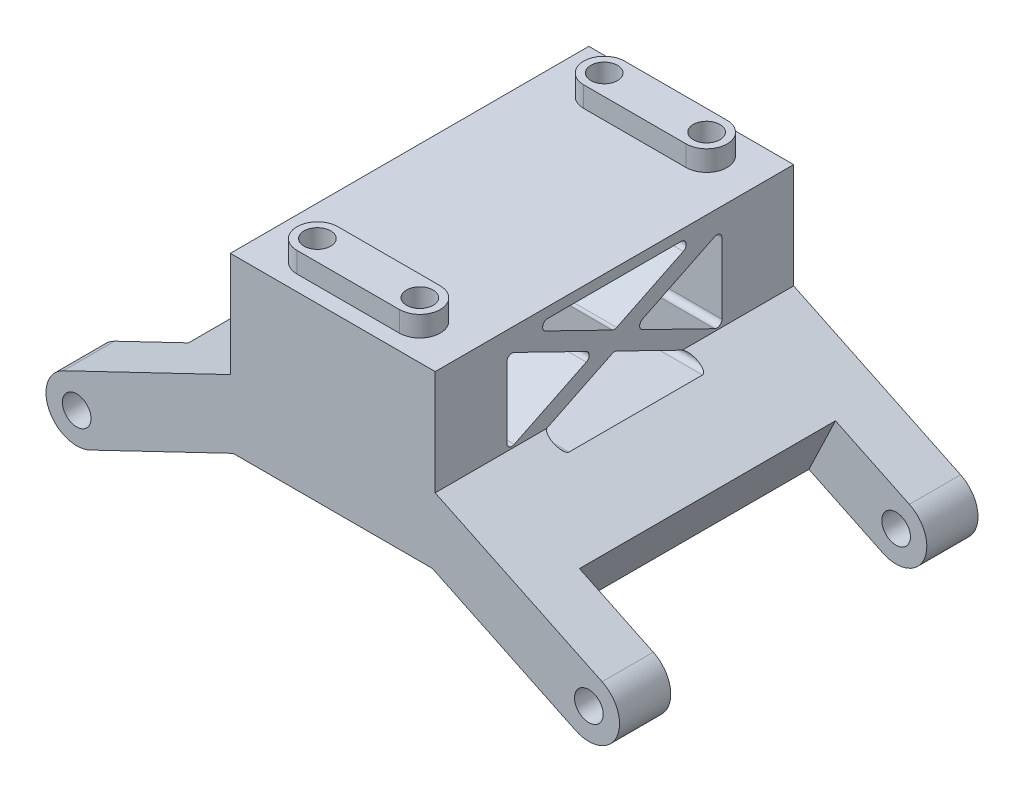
ISO-10303-21;
HEADER;
FILE_DESCRIPTION(('STEP AP214'),'2;1');
FILE_NAME('part.step','',(''),(''),'','','');
FILE_SCHEMA(('AUTOMOTIVE_DESIGN { 1 0 10303 214 1 1 1 1 }'));
ENDSEC;
DATA;
#1=APPLICATION_CONTEXT('core data for automotive mechanical design processes');
#2=APPLICATION_PROTOCOL_DEFINITION('international standard','automotive_design',2000,#1);
#3=PRODUCT_CONTEXT('',#1,'mechanical');
#4=PRODUCT('Part','Part','',(#3));
#5=PRODUCT_RELATED_PRODUCT_CATEGORY('part','',(#4));
#6=PRODUCT_DEFINITION_FORMATION('','',#4);
#7=PRODUCT_DEFINITION_CONTEXT('part definition',#1,'design');
#8=PRODUCT_DEFINITION('design','',#6,#7);
#9=PRODUCT_DEFINITION_SHAPE('','',#8);
#10=(LENGTH_UNIT() NAMED_UNIT(*) SI_UNIT(.MILLI.,.METRE.));
#11=(NAMED_UNIT(*) PLANE_ANGLE_UNIT() SI_UNIT($,.RADIAN.));
#12=(NAMED_UNIT(*) SI_UNIT($,.STERADIAN.) SOLID_ANGLE_UNIT());
#13=UNCERTAINTY_MEASURE_WITH_UNIT(LENGTH_MEASURE(1.E-05),#10,'distance_accuracy_value','');
#14=(GEOMETRIC_REPRESENTATION_CONTEXT(3) GLOBAL_UNCERTAINTY_ASSIGNED_CONTEXT((#13)) GLOBAL_UNIT_ASSIGNED_CONTEXT((#10,
#11,#12)) REPRESENTATION_CONTEXT('',''));
#15=CARTESIAN_POINT('',(0.,0.,0.));
#16=DIRECTION('',(0.,0.,1.));
#17=DIRECTION('',(1.,0.,0.));
#18=AXIS2_PLACEMENT_3D('',#15,#16,#17);
#19=CARTESIAN_POINT('',(-12.7,11.1536223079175,22.225));
#20=DIRECTION('',(0.,-1.,0.));
#21=DIRECTION('',(1.,0.,0.));
#22=AXIS2_PLACEMENT_3D('',#19,#20,#21);
#23=PLANE('',#22);
#24=CARTESIAN_POINT('',(-6.35,11.1536223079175,-17.78));
#25=DIRECTION('',(0.,1.,0.));
#26=DIRECTION('',(-1.,0.,0.));
#27=AXIS2_PLACEMENT_3D('',#24,#25,#26);
#28=CIRCLE('',#27,2.54);
#29=CARTESIAN_POINT('',(-6.35,11.1536223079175,-20.32));
#30=VERTEX_POINT('',#29);
#31=CARTESIAN_POINT('',(-6.35,11.1536223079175,-15.24));
#32=VERTEX_POINT('',#31);
#33=EDGE_CURVE('E543',#30,#32,#28,.T.);
#34=ORIENTED_EDGE('',*,*,#33,.F.);
#35=DIRECTION('',(-1.,0.,0.));
#36=VECTOR('',#35,1.);
#37=CARTESIAN_POINT('',(-6.35,11.1536223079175,-20.32));
#38=LINE('',#37,#36);
#39=CARTESIAN_POINT('',(6.35,11.1536223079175,-20.32));
#40=VERTEX_POINT('',#39);
#41=EDGE_CURVE('E548',#40,#30,#38,.T.);
#42=ORIENTED_EDGE('',*,*,#41,.F.);
#43=CARTESIAN_POINT('',(6.35,11.1536223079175,-17.78));
#44=DIRECTION('',(0.,1.,0.));
#45=DIRECTION('',(-1.,0.,0.));
#46=AXIS2_PLACEMENT_3D('',#43,#44,#45);
#47=CIRCLE('',#46,2.54);
#48=CARTESIAN_POINT('',(6.35,11.1536223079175,-15.24));
#49=VERTEX_POINT('',#48);
#50=EDGE_CURVE('E560',#49,#40,#47,.T.);
#51=ORIENTED_EDGE('',*,*,#50,.F.);
#52=DIRECTION('',(1.,0.,0.));
#53=VECTOR('',#52,1.);
#54=CARTESIAN_POINT('',(-6.35,11.1536223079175,-15.24));
#55=LINE('',#54,#53);
#56=EDGE_CURVE('E557',#32,#49,#55,.T.);
#57=ORIENTED_EDGE('',*,*,#56,.F.);
#58=EDGE_LOOP('',(#34,#42,#51,#57));
#59=FACE_BOUND('',#58,.T.);
#60=DIRECTION('',(-1.,0.,0.));
#61=VECTOR('',#60,1.);
#62=CARTESIAN_POINT('',(-12.7,11.1536223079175,-22.225));
#63=LINE('',#62,#61);
#64=CARTESIAN_POINT('',(12.7,11.1536223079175,-22.225));
#65=VERTEX_POINT('',#64);
#66=CARTESIAN_POINT('',(-12.7,11.1536223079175,-22.225));
#67=VERTEX_POINT('',#66);
#68=EDGE_CURVE('E649',#65,#67,#63,.T.);
#69=ORIENTED_EDGE('',*,*,#68,.T.);
#70=DIRECTION('',(0.,0.,-1.));
#71=VECTOR('',#70,1.);
#72=CARTESIAN_POINT('',(-12.7,11.1536223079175,22.225));
#73=LINE('',#72,#71);
#74=CARTESIAN_POINT('',(-12.7,11.1536223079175,22.225));
#75=VERTEX_POINT('',#74);
#76=EDGE_CURVE('E680',#75,#67,#73,.T.);
#77=ORIENTED_EDGE('',*,*,#76,.F.);
#78=DIRECTION('',(-1.,0.,0.));
#79=VECTOR('',#78,1.);
#80=CARTESIAN_POINT('',(-12.7,11.1536223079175,22.225));
#81=LINE('',#80,#79);
#82=CARTESIAN_POINT('',(12.7,11.1536223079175,22.225));
#83=VERTEX_POINT('',#82);
#84=EDGE_CURVE('E626',#83,#75,#81,.T.);
#85=ORIENTED_EDGE('',*,*,#84,.F.);
#86=DIRECTION('',(0.,0.,-1.));
#87=VECTOR('',#86,1.);
#88=CARTESIAN_POINT('',(12.7,11.1536223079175,22.225));
#89=LINE('',#88,#87);
#90=EDGE_CURVE('E683',#83,#65,#89,.T.);
#91=ORIENTED_EDGE('',*,*,#90,.T.);
#92=EDGE_LOOP('',(#69,#77,#85,#91));
#93=FACE_BOUND('',#92,.T.);
#94=CARTESIAN_POINT('',(-6.35,11.1536223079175,17.78));
#95=DIRECTION('',(0.,1.,0.));
#96=DIRECTION('',(-1.,0.,0.));
#97=AXIS2_PLACEMENT_3D('',#94,#95,#96);
#98=CIRCLE('',#97,2.54000000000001);
#99=CARTESIAN_POINT('',(-6.35,11.1536223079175,15.24));
#100=VERTEX_POINT('',#99);
#101=CARTESIAN_POINT('',(-6.35,11.1536223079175,20.32));
#102=VERTEX_POINT('',#101);
#103=EDGE_CURVE('E510',#100,#102,#98,.T.);
#104=ORIENTED_EDGE('',*,*,#103,.F.);
#105=DIRECTION('',(-1.,0.,0.));
#106=VECTOR('',#105,1.);
#107=CARTESIAN_POINT('',(-6.35,11.1536223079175,15.24));
#108=LINE('',#107,#106);
#109=CARTESIAN_POINT('',(6.35,11.1536223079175,15.24));
#110=VERTEX_POINT('',#109);
#111=EDGE_CURVE('E515',#110,#100,#108,.T.);
#112=ORIENTED_EDGE('',*,*,#111,.F.);
#113=CARTESIAN_POINT('',(6.35,11.1536223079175,17.78));
#114=DIRECTION('',(0.,1.,0.));
#115=DIRECTION('',(-1.,0.,0.));
#116=AXIS2_PLACEMENT_3D('',#113,#114,#115);
#117=CIRCLE('',#116,2.54000000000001);
#118=CARTESIAN_POINT('',(6.35,11.1536223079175,20.32));
#119=VERTEX_POINT('',#118);
#120=EDGE_CURVE('E527',#119,#110,#117,.T.);
#121=ORIENTED_EDGE('',*,*,#120,.F.);
#122=DIRECTION('',(1.,0.,0.));
#123=VECTOR('',#122,1.);
#124=CARTESIAN_POINT('',(-6.35,11.1536223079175,20.32));
#125=LINE('',#124,#123);
#126=EDGE_CURVE('E524',#102,#119,#125,.T.);
#127=ORIENTED_EDGE('',*,*,#126,.F.);
#128=EDGE_LOOP('',(#104,#112,#121,#127));
#129=FACE_BOUND('',#128,.T.);
#130=ADVANCED_FACE('F33',(#59,#93,#129),#23,.F.);
#131=CARTESIAN_POINT('',(30.101294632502,-18.6748028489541,22.225));
#132=DIRECTION('',(0.432731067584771,0.901523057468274,0.));
#133=DIRECTION('',(-0.901523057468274,0.432731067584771,0.));
#134=AXIS2_PLACEMENT_3D('',#131,#132,#133);
#135=PLANE('',#134);
#136=DIRECTION('',(0.901523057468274,-0.432731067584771,0.));
#137=VECTOR('',#136,1.);
#138=CARTESIAN_POINT('',(30.101294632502,-18.6748028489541,-15.875));
#139=LINE('',#138,#137);
#140=CARTESIAN_POINT('',(20.9418203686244,-14.2782552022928,-15.875));
#141=VERTEX_POINT('',#140);
#142=CARTESIAN_POINT('',(30.101294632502,-18.6748028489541,-15.875));
#143=VERTEX_POINT('',#142);
#144=EDGE_CURVE('E593',#141,#143,#139,.T.);
#145=ORIENTED_EDGE('',*,*,#144,.F.);
#146=DIRECTION('',(0.,0.,-1.));
#147=VECTOR('',#146,1.);
#148=CARTESIAN_POINT('',(20.9418203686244,-14.2782552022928,22.225));
#149=LINE('',#148,#147);
#150=CARTESIAN_POINT('',(20.9418203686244,-14.2782552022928,15.875));
#151=VERTEX_POINT('',#150);
#152=EDGE_CURVE('E595',#151,#141,#149,.T.);
#153=ORIENTED_EDGE('',*,*,#152,.F.);
#154=DIRECTION('',(-0.901523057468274,0.432731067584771,0.));
#155=VECTOR('',#154,1.);
#156=CARTESIAN_POINT('',(30.101294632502,-18.6748028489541,15.875));
#157=LINE('',#156,#155);
#158=CARTESIAN_POINT('',(30.101294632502,-18.6748028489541,15.875));
#159=VERTEX_POINT('',#158);
#160=EDGE_CURVE('E589',#159,#151,#157,.T.);
#161=ORIENTED_EDGE('',*,*,#160,.F.);
#162=DIRECTION('',(0.,0.,-1.));
#163=VECTOR('',#162,1.);
#164=CARTESIAN_POINT('',(30.101294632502,-18.6748028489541,22.225));
#165=LINE('',#164,#163);
#166=CARTESIAN_POINT('',(30.101294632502,-18.6748028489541,22.225));
#167=VERTEX_POINT('',#166);
#168=EDGE_CURVE('E695',#167,#159,#165,.T.);
#169=ORIENTED_EDGE('',*,*,#168,.F.);
#170=DIRECTION('',(0.901523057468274,-0.432731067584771,0.));
#171=VECTOR('',#170,1.);
#172=CARTESIAN_POINT('',(30.101294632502,-18.6748028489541,22.225));
#173=LINE('',#172,#171);
#174=CARTESIAN_POINT('',(12.3621220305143,-10.16,22.225));
#175=VERTEX_POINT('',#174);
#176=EDGE_CURVE('E616',#175,#167,#173,.T.);
#177=ORIENTED_EDGE('',*,*,#176,.F.);
#178=DIRECTION('',(0.,0.,-1.));
#179=VECTOR('',#178,1.);
#180=CARTESIAN_POINT('',(12.3621220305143,-10.16,22.225));
#181=LINE('',#180,#179);
#182=CARTESIAN_POINT('',(12.3621220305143,-10.16,-22.225));
#183=VERTEX_POINT('',#182);
#184=EDGE_CURVE('E638',#175,#183,#181,.T.);
#185=ORIENTED_EDGE('',*,*,#184,.T.);
#186=DIRECTION('',(0.901523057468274,-0.432731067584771,0.));
#187=VECTOR('',#186,1.);
#188=CARTESIAN_POINT('',(30.101294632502,-18.6748028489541,-22.225));
#189=LINE('',#188,#187);
#190=CARTESIAN_POINT('',(30.101294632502,-18.6748028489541,-22.225));
#191=VERTEX_POINT('',#190);
#192=EDGE_CURVE('E615',#183,#191,#189,.T.);
#193=ORIENTED_EDGE('',*,*,#192,.T.);
#194=EDGE_CURVE('E694',#143,#191,#165,.T.);
#195=ORIENTED_EDGE('',*,*,#194,.F.);
#196=EDGE_LOOP('',(#145,#153,#161,#169,#177,#185,#193,#195));
#197=FACE_BOUND('',#196,.T.);
#198=ADVANCED_FACE('F35',(#197),#135,.F.);
#199=CARTESIAN_POINT('',(31.75,-15.24,22.225));
#200=DIRECTION('',(0.,0.,-1.));
#201=DIRECTION('',(-1.,0.,0.));
#202=AXIS2_PLACEMENT_3D('',#199,#200,#201);
#203=CYLINDRICAL_SURFACE('',#202,3.80999999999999);
#204=CARTESIAN_POINT('',(31.75,-15.24,-15.875));
#205=DIRECTION('',(0.,0.,1.));
#206=DIRECTION('',(1.,0.,0.));
#207=AXIS2_PLACEMENT_3D('',#204,#205,#206);
#208=CIRCLE('',#207,3.80999999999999);
#209=CARTESIAN_POINT('',(33.398705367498,-11.8051971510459,-15.875));
#210=VERTEX_POINT('',#209);
#211=EDGE_CURVE('E591',#143,#210,#208,.T.);
#212=ORIENTED_EDGE('',*,*,#211,.F.);
#213=ORIENTED_EDGE('',*,*,#194,.T.);
#214=CARTESIAN_POINT('',(31.75,-15.24,-22.225));
#215=DIRECTION('',(0.,0.,1.));
#216=DIRECTION('',(-1.,0.,0.));
#217=AXIS2_PLACEMENT_3D('',#214,#215,#216);
#218=CIRCLE('',#217,3.80999999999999);
#219=CARTESIAN_POINT('',(33.398705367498,-11.8051971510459,-22.225));
#220=VERTEX_POINT('',#219);
#221=EDGE_CURVE('E641',#191,#220,#218,.T.);
#222=ORIENTED_EDGE('',*,*,#221,.T.);
#223=DIRECTION('',(0.,0.,-1.));
#224=VECTOR('',#223,1.);
#225=CARTESIAN_POINT('',(33.398705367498,-11.8051971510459,22.225));
#226=LINE('',#225,#224);
#227=EDGE_CURVE('E690',#210,#220,#226,.T.);
#228=ORIENTED_EDGE('',*,*,#227,.F.);
#229=EDGE_LOOP('',(#212,#213,#222,#228));
#230=FACE_BOUND('',#229,.T.);
#231=ADVANCED_FACE('F876',(#230),#203,.T.);
#232=CARTESIAN_POINT('',(31.75,-15.24,15.875));
#233=DIRECTION('',(0.,0.,-1.));
#234=DIRECTION('',(-1.,0.,0.));
#235=AXIS2_PLACEMENT_3D('',#232,#233,#234);
#236=CIRCLE('',#235,3.80999999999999);
#237=CARTESIAN_POINT('',(33.398705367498,-11.8051971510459,15.875));
#238=VERTEX_POINT('',#237);
#239=EDGE_CURVE('E585',#238,#159,#236,.T.);
#240=ORIENTED_EDGE('',*,*,#239,.F.);
#241=CARTESIAN_POINT('',(33.398705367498,-11.8051971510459,22.225));
#242=VERTEX_POINT('',#241);
#243=EDGE_CURVE('E691',#242,#238,#226,.T.);
#244=ORIENTED_EDGE('',*,*,#243,.F.);
#245=CARTESIAN_POINT('',(31.75,-15.24,22.225));
#246=DIRECTION('',(0.,0.,1.));
#247=DIRECTION('',(-1.,0.,0.));
#248=AXIS2_PLACEMENT_3D('',#245,#246,#247);
#249=CIRCLE('',#248,3.80999999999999);
#250=EDGE_CURVE('E619',#167,#242,#249,.T.);
#251=ORIENTED_EDGE('',*,*,#250,.F.);
#252=ORIENTED_EDGE('',*,*,#168,.T.);
#253=EDGE_LOOP('',(#240,#244,#251,#252));
#254=FACE_BOUND('',#253,.T.);
#255=ADVANCED_FACE('F856',(#254),#203,.T.);
#256=CARTESIAN_POINT('',(33.398705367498,-11.8051971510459,22.225));
#257=DIRECTION('',(-0.432731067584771,-0.901523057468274,0.));
#258=DIRECTION('',(0.901523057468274,-0.432731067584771,0.));
#259=AXIS2_PLACEMENT_3D('',#256,#257,#258);
#260=PLANE('',#259);
#261=CARTESIAN_POINT('',(14.0229166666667,-2.50481857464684,8.2720497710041));
#262=DIRECTION('',(-0.432731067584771,-0.901523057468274,0.));
#263=DIRECTION('',(0.901523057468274,-0.432731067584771,0.));
#264=AXIS2_PLACEMENT_3D('',#261,#262,#263);
#265=ELLIPSE('',#264,1.4674241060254,0.634999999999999);
#266=CARTESIAN_POINT('',(15.3458333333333,-3.13981857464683,8.27204977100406));
#267=VERTEX_POINT('',#266);
#268=CARTESIAN_POINT('',(12.8341613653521,-1.93421603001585,8.55068526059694));
#269=VERTEX_POINT('',#268);
#270=EDGE_CURVE('E407',#267,#269,#265,.T.);
#271=ORIENTED_EDGE('',*,*,#270,.T.);
#272=DIRECTION('',(-0.674718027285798,0.323864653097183,-0.663224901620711));
#273=VECTOR('',#272,1.);
#274=CARTESIAN_POINT('',(30.4721518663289,-10.4004514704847,25.888230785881));
#275=LINE('',#274,#273);
#276=CARTESIAN_POINT('',(12.7,-1.86981857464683,8.41880919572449));
#277=VERTEX_POINT('',#276);
#278=EDGE_CURVE('E404',#269,#277,#275,.T.);
#279=ORIENTED_EDGE('',*,*,#278,.T.);
#280=DIRECTION('',(0.,0.,-1.));
#281=VECTOR('',#280,1.);
#282=CARTESIAN_POINT('',(12.7,-1.86981857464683,22.225));
#283=LINE('',#282,#281);
#284=CARTESIAN_POINT('',(12.7,-1.86981857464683,22.225));
#285=VERTEX_POINT('',#284);
#286=EDGE_CURVE('E687',#285,#277,#283,.T.);
#287=ORIENTED_EDGE('',*,*,#286,.F.);
#288=DIRECTION('',(-0.901523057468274,0.432731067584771,0.));
#289=VECTOR('',#288,1.);
#290=CARTESIAN_POINT('',(33.398705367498,-11.8051971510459,22.225));
#291=LINE('',#290,#289);
#292=EDGE_CURVE('E622',#242,#285,#291,.T.);
#293=ORIENTED_EDGE('',*,*,#292,.F.);
#294=ORIENTED_EDGE('',*,*,#243,.T.);
#295=DIRECTION('',(0.901523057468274,-0.432731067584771,0.));
#296=VECTOR('',#295,1.);
#297=CARTESIAN_POINT('',(33.398705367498,-11.8051971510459,15.875));
#298=LINE('',#297,#296);
#299=CARTESIAN_POINT('',(24.2392311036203,-7.4086495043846,15.875));
#300=VERTEX_POINT('',#299);
#301=EDGE_CURVE('E707',#300,#238,#298,.T.);
#302=ORIENTED_EDGE('',*,*,#301,.F.);
#303=DIRECTION('',(0.,0.,-1.));
#304=VECTOR('',#303,1.);
#305=CARTESIAN_POINT('',(24.2392311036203,-7.4086495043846,-15.875));
#306=LINE('',#305,#304);
#307=CARTESIAN_POINT('',(24.2392311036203,-7.4086495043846,-15.875));
#308=VERTEX_POINT('',#307);
#309=EDGE_CURVE('E576',#300,#308,#306,.T.);
#310=ORIENTED_EDGE('',*,*,#309,.T.);
#311=DIRECTION('',(0.901523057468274,-0.432731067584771,0.));
#312=VECTOR('',#311,1.);
#313=CARTESIAN_POINT('',(42.5581796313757,-16.2017447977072,-15.875));
#314=LINE('',#313,#312);
#315=EDGE_CURVE('E579',#308,#210,#314,.T.);
#316=ORIENTED_EDGE('',*,*,#315,.T.);
#317=ORIENTED_EDGE('',*,*,#227,.T.);
#318=DIRECTION('',(-0.901523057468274,0.432731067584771,0.));
#319=VECTOR('',#318,1.);
#320=CARTESIAN_POINT('',(33.398705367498,-11.8051971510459,-22.225));
#321=LINE('',#320,#319);
#322=CARTESIAN_POINT('',(12.7,-1.86981857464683,-22.225));
#323=VERTEX_POINT('',#322);
#324=EDGE_CURVE('E644',#220,#323,#321,.T.);
#325=ORIENTED_EDGE('',*,*,#324,.T.);
#326=CARTESIAN_POINT('',(12.7,-1.86981857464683,-8.4188091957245));
#327=VERTEX_POINT('',#326);
#328=EDGE_CURVE('E686',#327,#323,#283,.T.);
#329=ORIENTED_EDGE('',*,*,#328,.F.);
#330=DIRECTION('',(0.674718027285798,-0.323864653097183,-0.663224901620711));
#331=VECTOR('',#330,1.);
#332=CARTESIAN_POINT('',(10.581230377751,-0.852809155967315,-6.33613062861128));
#333=LINE('',#332,#331);
#334=CARTESIAN_POINT('',(12.8341613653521,-1.93421603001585,-8.55068526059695));
#335=VERTEX_POINT('',#334);
#336=EDGE_CURVE('E387',#327,#335,#333,.T.);
#337=ORIENTED_EDGE('',*,*,#336,.T.);
#338=CARTESIAN_POINT('',(14.0229166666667,-2.50481857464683,-8.27204977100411));
#339=DIRECTION('',(-0.432731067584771,-0.901523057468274,0.));
#340=DIRECTION('',(0.901523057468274,-0.432731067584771,0.));
#341=AXIS2_PLACEMENT_3D('',#338,#339,#340);
#342=ELLIPSE('',#341,1.4674241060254,0.634999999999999);
#343=CARTESIAN_POINT('',(15.3458333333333,-3.13981857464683,-8.27204977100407));
#344=VERTEX_POINT('',#343);
#345=EDGE_CURVE('E372',#335,#344,#342,.T.);
#346=ORIENTED_EDGE('',*,*,#345,.T.);
#347=DIRECTION('',(0.,0.,1.));
#348=VECTOR('',#347,1.);
#349=CARTESIAN_POINT('',(15.3458333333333,-3.13981857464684,22.225));
#350=LINE('',#349,#348);
#351=EDGE_CURVE('E362',#344,#267,#350,.T.);
#352=ORIENTED_EDGE('',*,*,#351,.T.);
#353=EDGE_LOOP('',(#271,#279,#287,#293,#294,#302,#310,#316,#317,#325,#329,#337,#346,#352));
#354=FACE_BOUND('',#353,.T.);
#355=ADVANCED_FACE('F385',(#354),#260,.F.);
#356=CARTESIAN_POINT('',(-31.75,-15.24,22.225));
#357=DIRECTION('',(0.,0.,-1.));
#358=DIRECTION('',(-1.,0.,0.));
#359=AXIS2_PLACEMENT_3D('',#356,#357,#358);
#360=CYLINDRICAL_SURFACE('',#359,3.81);
#361=DIRECTION('',(0.,0.,-1.));
#362=VECTOR('',#361,1.);
#363=CARTESIAN_POINT('',(-33.398705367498,-11.8051971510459,22.225));
#364=LINE('',#363,#362);
#365=CARTESIAN_POINT('',(-33.398705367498,-11.8051971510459,22.225));
#366=VERTEX_POINT('',#365);
#367=CARTESIAN_POINT('',(-33.398705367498,-11.8051971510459,15.875));
#368=VERTEX_POINT('',#367);
#369=EDGE_CURVE('E673',#366,#368,#364,.T.);
#370=ORIENTED_EDGE('',*,*,#369,.T.);
#371=CARTESIAN_POINT('',(-31.75,-15.24,15.875));
#372=DIRECTION('',(0.,0.,1.));
#373=DIRECTION('',(1.,0.,0.));
#374=AXIS2_PLACEMENT_3D('',#371,#372,#373);
#375=CIRCLE('',#374,3.81);
#376=CARTESIAN_POINT('',(-30.101294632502,-18.6748028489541,15.875));
#377=VERTEX_POINT('',#376);
#378=EDGE_CURVE('E612',#368,#377,#375,.T.);
#379=ORIENTED_EDGE('',*,*,#378,.T.);
#380=DIRECTION('',(0.,0.,-1.));
#381=VECTOR('',#380,1.);
#382=CARTESIAN_POINT('',(-30.101294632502,-18.6748028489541,22.225));
#383=LINE('',#382,#381);
#384=CARTESIAN_POINT('',(-30.101294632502,-18.6748028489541,22.225));
#385=VERTEX_POINT('',#384);
#386=EDGE_CURVE('E669',#385,#377,#383,.T.);
#387=ORIENTED_EDGE('',*,*,#386,.F.);
#388=CARTESIAN_POINT('',(-31.75,-15.24,22.225));
#389=DIRECTION('',(0.,0.,1.));
#390=DIRECTION('',(1.,0.,0.));
#391=AXIS2_PLACEMENT_3D('',#388,#389,#390);
#392=CIRCLE('',#391,3.81);
#393=EDGE_CURVE('E632',#366,#385,#392,.T.);
#394=ORIENTED_EDGE('',*,*,#393,.F.);
#395=EDGE_LOOP('',(#370,#379,#387,#394));
#396=FACE_BOUND('',#395,.T.);
#397=ADVANCED_FACE('F916',(#396),#360,.T.);
#398=CARTESIAN_POINT('',(12.7,-1.86981857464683,22.225));
#399=DIRECTION('',(-1.,0.,0.));
#400=DIRECTION('',(0.,0.,1.));
#401=AXIS2_PLACEMENT_3D('',#398,#399,#400);
#402=PLANE('',#401);
#403=DIRECTION('',(0.,0.438796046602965,0.898586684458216));
#404=VECTOR('',#403,1.);
#405=CARTESIAN_POINT('',(12.7,12.0388496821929,15.433147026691));
#406=LINE('',#405,#404);
#407=CARTESIAN_POINT('',(12.7,4.63862901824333,0.278635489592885));
#408=VERTEX_POINT('',#407);
#409=CARTESIAN_POINT('',(12.7,8.67801976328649,8.55068526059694));
#410=VERTEX_POINT('',#409);
#411=EDGE_CURVE('E445',#408,#410,#406,.T.);
#412=ORIENTED_EDGE('',*,*,#411,.T.);
#413=CARTESIAN_POINT('',(12.7,9.24862230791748,8.2720497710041));
#414=DIRECTION('',(-1.,0.,0.));
#415=DIRECTION('',(0.,0.,1.));
#416=AXIS2_PLACEMENT_3D('',#413,#414,#415);
#417=CIRCLE('',#416,0.635);
#418=CARTESIAN_POINT('',(12.7,9.88362230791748,8.27204977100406));
#419=VERTEX_POINT('',#418);
#420=EDGE_CURVE('E460',#410,#419,#417,.T.);
#421=ORIENTED_EDGE('',*,*,#420,.T.);
#422=DIRECTION('',(0.,0.,-1.));
#423=VECTOR('',#422,1.);
#424=CARTESIAN_POINT('',(12.7,9.88362230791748,22.225));
#425=LINE('',#424,#423);
#426=CARTESIAN_POINT('',(12.7,9.88362230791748,-8.27204977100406));
#427=VERTEX_POINT('',#426);
#428=EDGE_CURVE('E457',#419,#427,#425,.T.);
#429=ORIENTED_EDGE('',*,*,#428,.T.);
#430=CARTESIAN_POINT('',(12.7,9.24862230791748,-8.2720497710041));
#431=DIRECTION('',(-1.,0.,0.));
#432=DIRECTION('',(0.,0.,1.));
#433=AXIS2_PLACEMENT_3D('',#430,#431,#432);
#434=CIRCLE('',#433,0.635);
#435=CARTESIAN_POINT('',(12.7,8.6780197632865,-8.55068526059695));
#436=VERTEX_POINT('',#435);
#437=EDGE_CURVE('E454',#427,#436,#434,.T.);
#438=ORIENTED_EDGE('',*,*,#437,.T.);
#439=DIRECTION('',(0.,-0.438796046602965,0.898586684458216));
#440=VECTOR('',#439,1.);
#441=CARTESIAN_POINT('',(12.7,-5.48762017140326,20.4583623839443));
#442=LINE('',#441,#440);
#443=CARTESIAN_POINT('',(12.7,4.63862901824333,-0.278635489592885));
#444=VERTEX_POINT('',#443);
#445=EDGE_CURVE('E451',#436,#444,#442,.T.);
#446=ORIENTED_EDGE('',*,*,#445,.T.);
#447=CARTESIAN_POINT('',(12.7,5.2092315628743,0.));
#448=DIRECTION('',(-1.,0.,0.));
#449=DIRECTION('',(0.,0.,1.));
#450=AXIS2_PLACEMENT_3D('',#447,#448,#449);
#451=CIRCLE('',#450,0.635);
#452=EDGE_CURVE('E448',#444,#408,#451,.T.);
#453=ORIENTED_EDGE('',*,*,#452,.T.);
#454=EDGE_LOOP('',(#412,#421,#429,#438,#446,#453));
#455=FACE_BOUND('',#454,.T.);
#456=DIRECTION('',(0.,0.438796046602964,-0.898586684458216));
#457=VECTOR('',#456,1.);
#458=CARTESIAN_POINT('',(12.7,-7.31354831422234,19.5667288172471));
#459=LINE('',#458,#457);
#460=CARTESIAN_POINT('',(12.7,3.9425044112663,-3.48393259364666));
#461=VERTEX_POINT('',#460);
#462=CARTESIAN_POINT('',(12.7,8.30681323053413,-12.4213645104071));
#463=VERTEX_POINT('',#462);
#464=EDGE_CURVE('E427',#461,#463,#459,.T.);
#465=ORIENTED_EDGE('',*,*,#464,.T.);
#466=CARTESIAN_POINT('',(12.7,7.73621068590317,-12.7));
#467=DIRECTION('',(-1.,0.,0.));
#468=DIRECTION('',(0.,0.,1.));
#469=AXIS2_PLACEMENT_3D('',#466,#467,#468);
#470=CIRCLE('',#469,0.635000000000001);
#471=CARTESIAN_POINT('',(12.7,7.73621068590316,-13.335));
#472=VERTEX_POINT('',#471);
#473=EDGE_CURVE('E442',#463,#472,#470,.T.);
#474=ORIENTED_EDGE('',*,*,#473,.T.);
#475=DIRECTION('',(0.,-1.,0.));
#476=VECTOR('',#475,1.);
#477=CARTESIAN_POINT('',(12.7,-1.86981857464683,-13.335));
#478=LINE('',#477,#476);
#479=CARTESIAN_POINT('',(12.7,-0.992406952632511,-13.335));
#480=VERTEX_POINT('',#479);
#481=EDGE_CURVE('E439',#472,#480,#478,.T.);
#482=ORIENTED_EDGE('',*,*,#481,.T.);
#483=CARTESIAN_POINT('',(12.7,-0.992406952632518,-12.7));
#484=DIRECTION('',(-1.,0.,0.));
#485=DIRECTION('',(0.,0.,1.));
#486=AXIS2_PLACEMENT_3D('',#483,#484,#485);
#487=CIRCLE('',#486,0.635);
#488=CARTESIAN_POINT('',(12.7,-1.56300949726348,-12.4213645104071));
#489=VERTEX_POINT('',#488);
#490=EDGE_CURVE('E436',#480,#489,#487,.T.);
#491=ORIENTED_EDGE('',*,*,#490,.T.);
#492=DIRECTION('',(0.,0.438796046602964,0.898586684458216));
#493=VECTOR('',#492,1.);
#494=CARTESIAN_POINT('',(12.7,12.0388496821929,15.433147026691));
#495=LINE('',#494,#493);
#496=CARTESIAN_POINT('',(12.7,2.80129932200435,-3.48393259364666));
#497=VERTEX_POINT('',#496);
#498=EDGE_CURVE('E433',#489,#497,#495,.T.);
#499=ORIENTED_EDGE('',*,*,#498,.T.);
#500=CARTESIAN_POINT('',(12.7,3.37190186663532,-3.76256808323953));
#501=DIRECTION('',(-1.,0.,0.));
#502=DIRECTION('',(0.,0.,1.));
#503=AXIS2_PLACEMENT_3D('',#500,#501,#502);
#504=CIRCLE('',#503,0.635);
#505=EDGE_CURVE('E430',#497,#461,#504,.T.);
#506=ORIENTED_EDGE('',*,*,#505,.T.);
#507=EDGE_LOOP('',(#465,#474,#482,#491,#499,#506));
#508=FACE_BOUND('',#507,.T.);
#509=DIRECTION('',(0.,-0.438796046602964,-0.898586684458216));
#510=VECTOR('',#509,1.);
#511=CARTESIAN_POINT('',(12.7,10.2129215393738,16.3247805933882));
#512=LINE('',#511,#510);
#513=CARTESIAN_POINT('',(12.7,8.30681323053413,12.4213645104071));
#514=VERTEX_POINT('',#513);
#515=CARTESIAN_POINT('',(12.7,3.9425044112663,3.48393259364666));
#516=VERTEX_POINT('',#515);
#517=EDGE_CURVE('E409',#514,#516,#512,.T.);
#518=ORIENTED_EDGE('',*,*,#517,.T.);
#519=CARTESIAN_POINT('',(12.7,3.37190186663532,3.76256808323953));
#520=DIRECTION('',(-1.,0.,0.));
#521=DIRECTION('',(0.,0.,1.));
#522=AXIS2_PLACEMENT_3D('',#519,#520,#521);
#523=CIRCLE('',#522,0.635);
#524=CARTESIAN_POINT('',(12.7,2.80129932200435,3.48393259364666));
#525=VERTEX_POINT('',#524);
#526=EDGE_CURVE('E424',#516,#525,#523,.T.);
#527=ORIENTED_EDGE('',*,*,#526,.T.);
#528=DIRECTION('',(0.,-0.438796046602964,0.898586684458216));
#529=VECTOR('',#528,1.);
#530=CARTESIAN_POINT('',(12.7,-5.48762017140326,20.4583623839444));
#531=LINE('',#530,#529);
#532=CARTESIAN_POINT('',(12.7,-1.56300949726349,12.4213645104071));
#533=VERTEX_POINT('',#532);
#534=EDGE_CURVE('E421',#525,#533,#531,.T.);
#535=ORIENTED_EDGE('',*,*,#534,.T.);
#536=CARTESIAN_POINT('',(12.7,-0.992406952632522,12.7));
#537=DIRECTION('',(-1.,0.,0.));
#538=DIRECTION('',(0.,0.,1.));
#539=AXIS2_PLACEMENT_3D('',#536,#537,#538);
#540=CIRCLE('',#539,0.635);
#541=CARTESIAN_POINT('',(12.7,-0.992406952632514,13.335));
#542=VERTEX_POINT('',#541);
#543=EDGE_CURVE('E418',#533,#542,#540,.T.);
#544=ORIENTED_EDGE('',*,*,#543,.T.);
#545=DIRECTION('',(0.,1.,0.));
#546=VECTOR('',#545,1.);
#547=CARTESIAN_POINT('',(12.7,-1.86981857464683,13.335));
#548=LINE('',#547,#546);
#549=CARTESIAN_POINT('',(12.7,7.73621068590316,13.335));
#550=VERTEX_POINT('',#549);
#551=EDGE_CURVE('E415',#542,#550,#548,.T.);
#552=ORIENTED_EDGE('',*,*,#551,.T.);
#553=CARTESIAN_POINT('',(12.7,7.73621068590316,12.7));
#554=DIRECTION('',(-1.,0.,0.));
#555=DIRECTION('',(0.,0.,1.));
#556=AXIS2_PLACEMENT_3D('',#553,#554,#555);
#557=CIRCLE('',#556,0.635000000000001);
#558=EDGE_CURVE('E412',#550,#514,#557,.T.);
#559=ORIENTED_EDGE('',*,*,#558,.T.);
#560=EDGE_LOOP('',(#518,#527,#535,#544,#552,#559));
#561=FACE_BOUND('',#560,.T.);
#562=ORIENTED_EDGE('',*,*,#286,.T.);
#563=DIRECTION('',(0.,0.438796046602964,-0.898586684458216));
#564=VECTOR('',#563,1.);
#565=CARTESIAN_POINT('',(12.7,-7.31354831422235,19.5667288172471));
#566=LINE('',#565,#564);
#567=CARTESIAN_POINT('',(12.7,2.10517471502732,0.278635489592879));
#568=VERTEX_POINT('',#567);
#569=EDGE_CURVE('E401',#277,#568,#566,.T.);
#570=ORIENTED_EDGE('',*,*,#569,.T.);
#571=CARTESIAN_POINT('',(12.7,1.53457217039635,0.));
#572=DIRECTION('',(-1.,0.,0.));
#573=DIRECTION('',(0.,0.,1.));
#574=AXIS2_PLACEMENT_3D('',#571,#572,#573);
#575=CIRCLE('',#574,0.635);
#576=CARTESIAN_POINT('',(12.7,2.10517471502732,-0.278635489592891));
#577=VERTEX_POINT('',#576);
#578=EDGE_CURVE('E463',#568,#577,#575,.T.);
#579=ORIENTED_EDGE('',*,*,#578,.T.);
#580=DIRECTION('',(0.,-0.438796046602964,-0.898586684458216));
#581=VECTOR('',#580,1.);
#582=CARTESIAN_POINT('',(12.7,10.2129215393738,16.3247805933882));
#583=LINE('',#582,#581);
#584=EDGE_CURVE('E391',#577,#327,#583,.T.);
#585=ORIENTED_EDGE('',*,*,#584,.T.);
#586=ORIENTED_EDGE('',*,*,#328,.T.);
#587=DIRECTION('',(0.,1.,0.));
#588=VECTOR('',#587,1.);
#589=CARTESIAN_POINT('',(12.7,-1.86981857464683,-22.225));
#590=LINE('',#589,#588);
#591=EDGE_CURVE('E647',#323,#65,#590,.T.);
#592=ORIENTED_EDGE('',*,*,#591,.T.);
#593=ORIENTED_EDGE('',*,*,#90,.F.);
#594=DIRECTION('',(0.,1.,0.));
#595=VECTOR('',#594,1.);
#596=CARTESIAN_POINT('',(12.7,-1.86981857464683,22.225));
#597=LINE('',#596,#595);
#598=EDGE_CURVE('E624',#285,#83,#597,.T.);
#599=ORIENTED_EDGE('',*,*,#598,.F.);
#600=EDGE_LOOP('',(#562,#570,#579,#585,#586,#592,#593,#599));
#601=FACE_BOUND('',#600,.T.);
#602=ADVANCED_FACE('F846',(#455,#508,#561,#601),#402,.F.);
#603=CARTESIAN_POINT('',(-12.7,-1.86981857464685,22.225));
#604=DIRECTION('',(1.,0.,0.));
#605=DIRECTION('',(0.,0.,-1.));
#606=AXIS2_PLACEMENT_3D('',#603,#604,#605);
#607=PLANE('',#606);
#608=DIRECTION('',(0.,0.,1.));
#609=VECTOR('',#608,1.);
#610=CARTESIAN_POINT('',(-12.7,9.88362230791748,22.225));
#611=LINE('',#610,#609);
#612=CARTESIAN_POINT('',(-12.7,9.88362230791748,-8.27204977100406));
#613=VERTEX_POINT('',#612);
#614=CARTESIAN_POINT('',(-12.7,9.88362230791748,8.27204977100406));
#615=VERTEX_POINT('',#614);
#616=EDGE_CURVE('E773',#613,#615,#611,.T.);
#617=ORIENTED_EDGE('',*,*,#616,.T.);
#618=CARTESIAN_POINT('',(-12.7,9.24862230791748,8.2720497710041));
#619=DIRECTION('',(1.,0.,0.));
#620=DIRECTION('',(0.,0.,-1.));
#621=AXIS2_PLACEMENT_3D('',#618,#619,#620);
#622=CIRCLE('',#621,0.635);
#623=CARTESIAN_POINT('',(-12.7,8.67801976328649,8.55068526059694));
#624=VERTEX_POINT('',#623);
#625=EDGE_CURVE('E41',#615,#624,#622,.T.);
#626=ORIENTED_EDGE('',*,*,#625,.T.);
#627=DIRECTION('',(0.,-0.438796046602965,-0.898586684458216));
#628=VECTOR('',#627,1.);
#629=CARTESIAN_POINT('',(-12.7,12.0388496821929,15.433147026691));
#630=LINE('',#629,#628);
#631=CARTESIAN_POINT('',(-12.7,4.63862901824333,0.278635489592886));
#632=VERTEX_POINT('',#631);
#633=EDGE_CURVE('E761',#624,#632,#630,.T.);
#634=ORIENTED_EDGE('',*,*,#633,.T.);
#635=CARTESIAN_POINT('',(-12.7,5.2092315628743,0.));
#636=DIRECTION('',(1.,0.,0.));
#637=DIRECTION('',(0.,0.,-1.));
#638=AXIS2_PLACEMENT_3D('',#635,#636,#637);
#639=CIRCLE('',#638,0.635);
#640=CARTESIAN_POINT('',(-12.7,4.63862901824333,-0.278635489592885));
#641=VERTEX_POINT('',#640);
#642=EDGE_CURVE('E764',#632,#641,#639,.T.);
#643=ORIENTED_EDGE('',*,*,#642,.T.);
#644=DIRECTION('',(0.,0.438796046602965,-0.898586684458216));
#645=VECTOR('',#644,1.);
#646=CARTESIAN_POINT('',(-12.7,-5.48762017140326,20.4583623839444));
#647=LINE('',#646,#645);
#648=CARTESIAN_POINT('',(-12.7,8.6780197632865,-8.55068526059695));
#649=VERTEX_POINT('',#648);
#650=EDGE_CURVE('E767',#641,#649,#647,.T.);
#651=ORIENTED_EDGE('',*,*,#650,.T.);
#652=CARTESIAN_POINT('',(-12.7,9.24862230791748,-8.2720497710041));
#653=DIRECTION('',(1.,0.,0.));
#654=DIRECTION('',(0.,0.,-1.));
#655=AXIS2_PLACEMENT_3D('',#652,#653,#654);
#656=CIRCLE('',#655,0.635);
#657=EDGE_CURVE('E770',#649,#613,#656,.T.);
#658=ORIENTED_EDGE('',*,*,#657,.T.);
#659=EDGE_LOOP('',(#617,#626,#634,#643,#651,#658));
#660=FACE_BOUND('',#659,.T.);
#661=DIRECTION('',(0.,1.,0.));
#662=VECTOR('',#661,1.);
#663=CARTESIAN_POINT('',(-12.7,-1.86981857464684,-13.335));
#664=LINE('',#663,#662);
#665=CARTESIAN_POINT('',(-12.7,-0.992406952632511,-13.335));
#666=VERTEX_POINT('',#665);
#667=CARTESIAN_POINT('',(-12.7,7.73621068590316,-13.335));
#668=VERTEX_POINT('',#667);
#669=EDGE_CURVE('E755',#666,#668,#664,.T.);
#670=ORIENTED_EDGE('',*,*,#669,.T.);
#671=CARTESIAN_POINT('',(-12.7,7.73621068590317,-12.7));
#672=DIRECTION('',(1.,0.,0.));
#673=DIRECTION('',(0.,0.,-1.));
#674=AXIS2_PLACEMENT_3D('',#671,#672,#673);
#675=CIRCLE('',#674,0.635000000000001);
#676=CARTESIAN_POINT('',(-12.7,8.30681323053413,-12.4213645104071));
#677=VERTEX_POINT('',#676);
#678=EDGE_CURVE('E758',#668,#677,#675,.T.);
#679=ORIENTED_EDGE('',*,*,#678,.T.);
#680=DIRECTION('',(0.,-0.438796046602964,0.898586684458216));
#681=VECTOR('',#680,1.);
#682=CARTESIAN_POINT('',(-12.7,-7.31354831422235,19.5667288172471));
#683=LINE('',#682,#681);
#684=CARTESIAN_POINT('',(-12.7,3.9425044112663,-3.48393259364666));
#685=VERTEX_POINT('',#684);
#686=EDGE_CURVE('E743',#677,#685,#683,.T.);
#687=ORIENTED_EDGE('',*,*,#686,.T.);
#688=CARTESIAN_POINT('',(-12.7,3.37190186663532,-3.76256808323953));
#689=DIRECTION('',(1.,0.,0.));
#690=DIRECTION('',(0.,0.,-1.));
#691=AXIS2_PLACEMENT_3D('',#688,#689,#690);
#692=CIRCLE('',#691,0.635);
#693=CARTESIAN_POINT('',(-12.7,2.80129932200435,-3.48393259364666));
#694=VERTEX_POINT('',#693);
#695=EDGE_CURVE('E746',#685,#694,#692,.T.);
#696=ORIENTED_EDGE('',*,*,#695,.T.);
#697=DIRECTION('',(0.,-0.438796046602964,-0.898586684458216));
#698=VECTOR('',#697,1.);
#699=CARTESIAN_POINT('',(-12.7,12.0388496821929,15.433147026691));
#700=LINE('',#699,#698);
#701=CARTESIAN_POINT('',(-12.7,-1.56300949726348,-12.4213645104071));
#702=VERTEX_POINT('',#701);
#703=EDGE_CURVE('E749',#694,#702,#700,.T.);
#704=ORIENTED_EDGE('',*,*,#703,.T.);
#705=CARTESIAN_POINT('',(-12.7,-0.992406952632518,-12.7));
#706=DIRECTION('',(1.,0.,0.));
#707=DIRECTION('',(0.,0.,-1.));
#708=AXIS2_PLACEMENT_3D('',#705,#706,#707);
#709=CIRCLE('',#708,0.635);
#710=EDGE_CURVE('E752',#702,#666,#709,.T.);
#711=ORIENTED_EDGE('',*,*,#710,.T.);
#712=EDGE_LOOP('',(#670,#679,#687,#696,#704,#711));
#713=FACE_BOUND('',#712,.T.);
#714=DIRECTION('',(0.,0.438796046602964,-0.898586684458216));
#715=VECTOR('',#714,1.);
#716=CARTESIAN_POINT('',(-12.7,-5.48762017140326,20.4583623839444));
#717=LINE('',#716,#715);
#718=CARTESIAN_POINT('',(-12.7,-1.56300949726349,12.4213645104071));
#719=VERTEX_POINT('',#718);
#720=CARTESIAN_POINT('',(-12.7,2.80129932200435,3.48393259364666));
#721=VERTEX_POINT('',#720);
#722=EDGE_CURVE('E737',#719,#721,#717,.T.);
#723=ORIENTED_EDGE('',*,*,#722,.T.);
#724=CARTESIAN_POINT('',(-12.7,3.37190186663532,3.76256808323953));
#725=DIRECTION('',(1.,0.,0.));
#726=DIRECTION('',(0.,0.,-1.));
#727=AXIS2_PLACEMENT_3D('',#724,#725,#726);
#728=CIRCLE('',#727,0.635);
#729=CARTESIAN_POINT('',(-12.7,3.94250441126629,3.48393259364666));
#730=VERTEX_POINT('',#729);
#731=EDGE_CURVE('E740',#721,#730,#728,.T.);
#732=ORIENTED_EDGE('',*,*,#731,.T.);
#733=DIRECTION('',(0.,0.438796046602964,0.898586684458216));
#734=VECTOR('',#733,1.);
#735=CARTESIAN_POINT('',(-12.7,10.2129215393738,16.3247805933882));
#736=LINE('',#735,#734);
#737=CARTESIAN_POINT('',(-12.7,8.30681323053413,12.4213645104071));
#738=VERTEX_POINT('',#737);
#739=EDGE_CURVE('E725',#730,#738,#736,.T.);
#740=ORIENTED_EDGE('',*,*,#739,.T.);
#741=CARTESIAN_POINT('',(-12.7,7.73621068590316,12.7));
#742=DIRECTION('',(1.,0.,0.));
#743=DIRECTION('',(0.,0.,-1.));
#744=AXIS2_PLACEMENT_3D('',#741,#742,#743);
#745=CIRCLE('',#744,0.635000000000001);
#746=CARTESIAN_POINT('',(-12.7,7.73621068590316,13.335));
#747=VERTEX_POINT('',#746);
#748=EDGE_CURVE('E728',#738,#747,#745,.T.);
#749=ORIENTED_EDGE('',*,*,#748,.T.);
#750=DIRECTION('',(0.,-1.,0.));
#751=VECTOR('',#750,1.);
#752=CARTESIAN_POINT('',(-12.7,-1.86981857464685,13.335));
#753=LINE('',#752,#751);
#754=CARTESIAN_POINT('',(-12.7,-0.992406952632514,13.335));
#755=VERTEX_POINT('',#754);
#756=EDGE_CURVE('E731',#747,#755,#753,.T.);
#757=ORIENTED_EDGE('',*,*,#756,.T.);
#758=CARTESIAN_POINT('',(-12.7,-0.992406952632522,12.7));
#759=DIRECTION('',(1.,0.,0.));
#760=DIRECTION('',(0.,0.,-1.));
#761=AXIS2_PLACEMENT_3D('',#758,#759,#760);
#762=CIRCLE('',#761,0.635);
#763=EDGE_CURVE('E734',#755,#719,#762,.T.);
#764=ORIENTED_EDGE('',*,*,#763,.T.);
#765=EDGE_LOOP('',(#723,#732,#740,#749,#757,#764));
#766=FACE_BOUND('',#765,.T.);
#767=CARTESIAN_POINT('',(-12.7,1.53457217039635,0.));
#768=DIRECTION('',(1.,0.,0.));
#769=DIRECTION('',(0.,0.,-1.));
#770=AXIS2_PLACEMENT_3D('',#767,#768,#769);
#771=CIRCLE('',#770,0.635);
#772=CARTESIAN_POINT('',(-12.7,2.10517471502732,-0.278635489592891));
#773=VERTEX_POINT('',#772);
#774=CARTESIAN_POINT('',(-12.7,2.10517471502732,0.278635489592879));
#775=VERTEX_POINT('',#774);
#776=EDGE_CURVE('E11',#773,#775,#771,.T.);
#777=ORIENTED_EDGE('',*,*,#776,.T.);
#778=DIRECTION('',(0.,-0.438796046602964,0.898586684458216));
#779=VECTOR('',#778,1.);
#780=CARTESIAN_POINT('',(-12.7,-7.31354831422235,19.5667288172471));
#781=LINE('',#780,#779);
#782=CARTESIAN_POINT('',(-12.7,-1.86981857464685,8.41880919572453));
#783=VERTEX_POINT('',#782);
#784=EDGE_CURVE('E398',#775,#783,#781,.T.);
#785=ORIENTED_EDGE('',*,*,#784,.T.);
#786=DIRECTION('',(0.,0.,-1.));
#787=VECTOR('',#786,1.);
#788=CARTESIAN_POINT('',(-12.7,-1.86981857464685,22.225));
#789=LINE('',#788,#787);
#790=CARTESIAN_POINT('',(-12.7,-1.86981857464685,22.225));
#791=VERTEX_POINT('',#790);
#792=EDGE_CURVE('E677',#791,#783,#789,.T.);
#793=ORIENTED_EDGE('',*,*,#792,.F.);
#794=DIRECTION('',(0.,-1.,0.));
#795=VECTOR('',#794,1.);
#796=CARTESIAN_POINT('',(-12.7,-1.86981857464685,22.225));
#797=LINE('',#796,#795);
#798=EDGE_CURVE('E628',#75,#791,#797,.T.);
#799=ORIENTED_EDGE('',*,*,#798,.F.);
#800=ORIENTED_EDGE('',*,*,#76,.T.);
#801=DIRECTION('',(0.,-1.,0.));
#802=VECTOR('',#801,1.);
#803=CARTESIAN_POINT('',(-12.7,-1.86981857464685,-22.225));
#804=LINE('',#803,#802);
#805=CARTESIAN_POINT('',(-12.7,-1.86981857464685,-22.225));
#806=VERTEX_POINT('',#805);
#807=EDGE_CURVE('E651',#67,#806,#804,.T.);
#808=ORIENTED_EDGE('',*,*,#807,.T.);
#809=CARTESIAN_POINT('',(-12.7,-1.86981857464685,-8.41880919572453));
#810=VERTEX_POINT('',#809);
#811=EDGE_CURVE('E676',#810,#806,#789,.T.);
#812=ORIENTED_EDGE('',*,*,#811,.F.);
#813=DIRECTION('',(0.,0.438796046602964,0.898586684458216));
#814=VECTOR('',#813,1.);
#815=CARTESIAN_POINT('',(-12.7,10.2129215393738,16.3247805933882));
#816=LINE('',#815,#814);
#817=EDGE_CURVE('E388',#810,#773,#816,.T.);
#818=ORIENTED_EDGE('',*,*,#817,.T.);
#819=EDGE_LOOP('',(#777,#785,#793,#799,#800,#808,#812,#818));
#820=FACE_BOUND('',#819,.T.);
#821=ADVANCED_FACE('F777',(#660,#713,#766,#820),#607,.F.);
#822=CARTESIAN_POINT('',(-33.398705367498,-11.8051971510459,22.225));
#823=DIRECTION('',(0.432731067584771,-0.901523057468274,0.));
#824=DIRECTION('',(0.901523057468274,0.432731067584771,0.));
#825=AXIS2_PLACEMENT_3D('',#822,#823,#824);
#826=PLANE('',#825);
#827=ORIENTED_EDGE('',*,*,#792,.T.);
#828=DIRECTION('',(-0.674718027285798,-0.323864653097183,0.663224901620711));
#829=VECTOR('',#828,1.);
#830=CARTESIAN_POINT('',(-30.4721518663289,-10.4004514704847,25.888230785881));
#831=LINE('',#830,#829);
#832=CARTESIAN_POINT('',(-12.8341613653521,-1.93421603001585,8.55068526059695));
#833=VERTEX_POINT('',#832);
#834=EDGE_CURVE('E722',#783,#833,#831,.T.);
#835=ORIENTED_EDGE('',*,*,#834,.T.);
#836=CARTESIAN_POINT('',(-14.0229166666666,-2.50481857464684,8.2720497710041));
#837=DIRECTION('',(0.432731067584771,-0.901523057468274,0.));
#838=DIRECTION('',(0.901523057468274,0.432731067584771,0.));
#839=AXIS2_PLACEMENT_3D('',#836,#837,#838);
#840=ELLIPSE('',#839,1.4674241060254,0.634999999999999);
#841=CARTESIAN_POINT('',(-15.3458333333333,-3.13981857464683,8.27204977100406));
#842=VERTEX_POINT('',#841);
#843=EDGE_CURVE('E719',#833,#842,#840,.T.);
#844=ORIENTED_EDGE('',*,*,#843,.T.);
#845=DIRECTION('',(0.,0.,-1.));
#846=VECTOR('',#845,1.);
#847=CARTESIAN_POINT('',(-15.3458333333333,-3.13981857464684,22.225));
#848=LINE('',#847,#846);
#849=CARTESIAN_POINT('',(-15.3458333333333,-3.13981857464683,-8.27204977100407));
#850=VERTEX_POINT('',#849);
#851=EDGE_CURVE('E709',#842,#850,#848,.T.);
#852=ORIENTED_EDGE('',*,*,#851,.T.);
#853=CARTESIAN_POINT('',(-14.0229166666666,-2.50481857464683,-8.27204977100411));
#854=DIRECTION('',(0.432731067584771,-0.901523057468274,0.));
#855=DIRECTION('',(0.901523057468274,0.432731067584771,0.));
#856=AXIS2_PLACEMENT_3D('',#853,#854,#855);
#857=ELLIPSE('',#856,1.4674241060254,0.634999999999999);
#858=CARTESIAN_POINT('',(-12.8341613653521,-1.93421603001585,-8.55068526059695));
#859=VERTEX_POINT('',#858);
#860=EDGE_CURVE('E380',#850,#859,#857,.T.);
#861=ORIENTED_EDGE('',*,*,#860,.T.);
#862=DIRECTION('',(0.674718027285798,0.323864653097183,0.663224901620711));
#863=VECTOR('',#862,1.);
#864=CARTESIAN_POINT('',(-10.581230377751,-0.85280915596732,-6.3361306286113));
#865=LINE('',#864,#863);
#866=EDGE_CURVE('E716',#859,#810,#865,.T.);
#867=ORIENTED_EDGE('',*,*,#866,.T.);
#868=ORIENTED_EDGE('',*,*,#811,.T.);
#869=DIRECTION('',(-0.901523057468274,-0.432731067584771,0.));
#870=VECTOR('',#869,1.);
#871=CARTESIAN_POINT('',(-33.398705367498,-11.8051971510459,-22.225));
#872=LINE('',#871,#870);
#873=CARTESIAN_POINT('',(-33.398705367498,-11.8051971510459,-22.225));
#874=VERTEX_POINT('',#873);
#875=EDGE_CURVE('E654',#806,#874,#872,.T.);
#876=ORIENTED_EDGE('',*,*,#875,.T.);
#877=CARTESIAN_POINT('',(-33.398705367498,-11.8051971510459,-15.875));
#878=VERTEX_POINT('',#877);
#879=EDGE_CURVE('E672',#878,#874,#364,.T.);
#880=ORIENTED_EDGE('',*,*,#879,.F.);
#881=DIRECTION('',(-0.901523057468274,-0.432731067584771,0.));
#882=VECTOR('',#881,1.);
#883=CARTESIAN_POINT('',(-42.5581796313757,-16.2017447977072,-15.875));
#884=LINE('',#883,#882);
#885=CARTESIAN_POINT('',(-24.2392311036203,-7.4086495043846,-15.875));
#886=VERTEX_POINT('',#885);
#887=EDGE_CURVE('E600',#886,#878,#884,.T.);
#888=ORIENTED_EDGE('',*,*,#887,.F.);
#889=DIRECTION('',(0.,0.,-1.));
#890=VECTOR('',#889,1.);
#891=CARTESIAN_POINT('',(-24.2392311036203,-7.4086495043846,-15.875));
#892=LINE('',#891,#890);
#893=CARTESIAN_POINT('',(-24.2392311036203,-7.4086495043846,15.875));
#894=VERTEX_POINT('',#893);
#895=EDGE_CURVE('E597',#894,#886,#892,.T.);
#896=ORIENTED_EDGE('',*,*,#895,.F.);
#897=DIRECTION('',(0.901523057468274,0.432731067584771,0.));
#898=VECTOR('',#897,1.);
#899=CARTESIAN_POINT('',(-42.5581796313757,-16.2017447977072,15.875));
#900=LINE('',#899,#898);
#901=EDGE_CURVE('E602',#368,#894,#900,.T.);
#902=ORIENTED_EDGE('',*,*,#901,.F.);
#903=ORIENTED_EDGE('',*,*,#369,.F.);
#904=DIRECTION('',(-0.901523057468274,-0.432731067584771,0.));
#905=VECTOR('',#904,1.);
#906=CARTESIAN_POINT('',(-33.398705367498,-11.8051971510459,22.225));
#907=LINE('',#906,#905);
#908=EDGE_CURVE('E630',#791,#366,#907,.T.);
#909=ORIENTED_EDGE('',*,*,#908,.F.);
#910=EDGE_LOOP('',(#827,#835,#844,#852,#861,#867,#868,#876,#880,#888,#896,#902,#903,#909));
#911=FACE_BOUND('',#910,.T.);
#912=ADVANCED_FACE('F838',(#911),#826,.F.);
#913=CARTESIAN_POINT('',(-30.101294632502,-18.6748028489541,-15.875));
#914=VERTEX_POINT('',#913);
#915=CARTESIAN_POINT('',(-30.101294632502,-18.6748028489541,-22.225));
#916=VERTEX_POINT('',#915);
#917=EDGE_CURVE('E668',#914,#916,#383,.T.);
#918=ORIENTED_EDGE('',*,*,#917,.F.);
#919=CARTESIAN_POINT('',(-31.75,-15.24,-15.875));
#920=DIRECTION('',(0.,0.,-1.));
#921=DIRECTION('',(-1.,0.,0.));
#922=AXIS2_PLACEMENT_3D('',#919,#920,#921);
#923=CIRCLE('',#922,3.81);
#924=EDGE_CURVE('E608',#914,#878,#923,.T.);
#925=ORIENTED_EDGE('',*,*,#924,.T.);
#926=ORIENTED_EDGE('',*,*,#879,.T.);
#927=CARTESIAN_POINT('',(-31.75,-15.24,-22.225));
#928=DIRECTION('',(0.,0.,1.));
#929=DIRECTION('',(1.,0.,0.));
#930=AXIS2_PLACEMENT_3D('',#927,#928,#929);
#931=CIRCLE('',#930,3.81);
#932=EDGE_CURVE('E657',#874,#916,#931,.T.);
#933=ORIENTED_EDGE('',*,*,#932,.T.);
#934=EDGE_LOOP('',(#918,#925,#926,#933));
#935=FACE_BOUND('',#934,.T.);
#936=ADVANCED_FACE('F899',(#935),#360,.T.);
#937=CARTESIAN_POINT('',(-30.101294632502,-18.6748028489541,22.225));
#938=DIRECTION('',(-0.432731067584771,0.901523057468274,0.));
#939=DIRECTION('',(-0.901523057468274,-0.432731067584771,0.));
#940=AXIS2_PLACEMENT_3D('',#937,#938,#939);
#941=PLANE('',#940);
#942=ORIENTED_EDGE('',*,*,#386,.T.);
#943=DIRECTION('',(0.901523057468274,0.432731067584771,0.));
#944=VECTOR('',#943,1.);
#945=CARTESIAN_POINT('',(-30.101294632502,-18.6748028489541,15.875));
#946=LINE('',#945,#944);
#947=CARTESIAN_POINT('',(-20.9418203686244,-14.2782552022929,15.875));
#948=VERTEX_POINT('',#947);
#949=EDGE_CURVE('E704',#377,#948,#946,.T.);
#950=ORIENTED_EDGE('',*,*,#949,.T.);
#951=DIRECTION('',(0.,0.,-1.));
#952=VECTOR('',#951,1.);
#953=CARTESIAN_POINT('',(-20.9418203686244,-14.2782552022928,22.225));
#954=LINE('',#953,#952);
#955=CARTESIAN_POINT('',(-20.9418203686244,-14.2782552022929,-15.875));
#956=VERTEX_POINT('',#955);
#957=EDGE_CURVE('E701',#948,#956,#954,.T.);
#958=ORIENTED_EDGE('',*,*,#957,.T.);
#959=DIRECTION('',(-0.901523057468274,-0.432731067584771,0.));
#960=VECTOR('',#959,1.);
#961=CARTESIAN_POINT('',(-30.101294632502,-18.6748028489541,-15.875));
#962=LINE('',#961,#960);
#963=EDGE_CURVE('E698',#956,#914,#962,.T.);
#964=ORIENTED_EDGE('',*,*,#963,.T.);
#965=ORIENTED_EDGE('',*,*,#917,.T.);
#966=DIRECTION('',(0.901523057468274,0.432731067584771,0.));
#967=VECTOR('',#966,1.);
#968=CARTESIAN_POINT('',(-30.101294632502,-18.6748028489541,-22.225));
#969=LINE('',#968,#967);
#970=CARTESIAN_POINT('',(-12.3621220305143,-10.16,-22.225));
#971=VERTEX_POINT('',#970);
#972=EDGE_CURVE('E660',#916,#971,#969,.T.);
#973=ORIENTED_EDGE('',*,*,#972,.T.);
#974=DIRECTION('',(0.,0.,-1.));
#975=VECTOR('',#974,1.);
#976=CARTESIAN_POINT('',(-12.3621220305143,-10.16,22.225));
#977=LINE('',#976,#975);
#978=CARTESIAN_POINT('',(-12.3621220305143,-10.16,22.225));
#979=VERTEX_POINT('',#978);
#980=EDGE_CURVE('E665',#979,#971,#977,.T.);
#981=ORIENTED_EDGE('',*,*,#980,.F.);
#982=DIRECTION('',(0.901523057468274,0.432731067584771,0.));
#983=VECTOR('',#982,1.);
#984=CARTESIAN_POINT('',(-30.101294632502,-18.6748028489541,22.225));
#985=LINE('',#984,#983);
#986=EDGE_CURVE('E634',#385,#979,#985,.T.);
#987=ORIENTED_EDGE('',*,*,#986,.F.);
#988=EDGE_LOOP('',(#942,#950,#958,#964,#965,#973,#981,#987));
#989=FACE_BOUND('',#988,.T.);
#990=ADVANCED_FACE('F904',(#989),#941,.F.);
#991=CARTESIAN_POINT('',(12.3621220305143,-10.16,22.225));
#992=DIRECTION('',(0.,1.,0.));
#993=DIRECTION('',(-1.,0.,0.));
#994=AXIS2_PLACEMENT_3D('',#991,#992,#993);
#995=PLANE('',#994);
#996=CARTESIAN_POINT('',(-6.35,-10.16,17.78));
#997=DIRECTION('',(0.,1.,0.));
#998=DIRECTION('',(-1.,0.,0.));
#999=AXIS2_PLACEMENT_3D('',#996,#997,#998);
#1000=CIRCLE('',#999,1.651);
#1001=CARTESIAN_POINT('',(-8.001,-10.16,17.78));
#1002=VERTEX_POINT('',#1001);
#1003=EDGE_CURVE('E501',#1002,#1002,#1000,.T.);
#1004=ORIENTED_EDGE('',*,*,#1003,.T.);
#1005=EDGE_LOOP('',(#1004));
#1006=FACE_BOUND('',#1005,.T.);
#1007=CARTESIAN_POINT('',(6.35,-10.16,17.78));
#1008=DIRECTION('',(0.,1.,0.));
#1009=DIRECTION('',(-1.,0.,0.));
#1010=AXIS2_PLACEMENT_3D('',#1007,#1008,#1009);
#1011=CIRCLE('',#1010,1.651);
#1012=CARTESIAN_POINT('',(4.699,-10.16,17.78));
#1013=VERTEX_POINT('',#1012);
#1014=EDGE_CURVE('E498',#1013,#1013,#1011,.T.);
#1015=ORIENTED_EDGE('',*,*,#1014,.T.);
#1016=EDGE_LOOP('',(#1015));
#1017=FACE_BOUND('',#1016,.T.);
#1018=CARTESIAN_POINT('',(6.35,-10.16,-17.78));
#1019=DIRECTION('',(0.,1.,0.));
#1020=DIRECTION('',(-1.,0.,0.));
#1021=AXIS2_PLACEMENT_3D('',#1018,#1019,#1020);
#1022=CIRCLE('',#1021,1.651);
#1023=CARTESIAN_POINT('',(4.699,-10.16,-17.78));
#1024=VERTEX_POINT('',#1023);
#1025=EDGE_CURVE('E507',#1024,#1024,#1022,.T.);
#1026=ORIENTED_EDGE('',*,*,#1025,.T.);
#1027=EDGE_LOOP('',(#1026));
#1028=FACE_BOUND('',#1027,.T.);
#1029=CARTESIAN_POINT('',(-6.35,-10.16,-17.78));
#1030=DIRECTION('',(0.,1.,0.));
#1031=DIRECTION('',(-1.,0.,0.));
#1032=AXIS2_PLACEMENT_3D('',#1029,#1030,#1031);
#1033=CIRCLE('',#1032,1.651);
#1034=CARTESIAN_POINT('',(-8.001,-10.16,-17.78));
#1035=VERTEX_POINT('',#1034);
#1036=EDGE_CURVE('E504',#1035,#1035,#1033,.T.);
#1037=ORIENTED_EDGE('',*,*,#1036,.T.);
#1038=EDGE_LOOP('',(#1037));
#1039=FACE_BOUND('',#1038,.T.);
#1040=DIRECTION('',(1.,0.,0.));
#1041=VECTOR('',#1040,1.);
#1042=CARTESIAN_POINT('',(12.3621220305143,-10.16,-22.225));
#1043=LINE('',#1042,#1041);
#1044=EDGE_CURVE('E620',#971,#183,#1043,.T.);
#1045=ORIENTED_EDGE('',*,*,#1044,.T.);
#1046=ORIENTED_EDGE('',*,*,#184,.F.);
#1047=DIRECTION('',(1.,0.,0.));
#1048=VECTOR('',#1047,1.);
#1049=CARTESIAN_POINT('',(12.3621220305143,-10.16,22.225));
#1050=LINE('',#1049,#1048);
#1051=EDGE_CURVE('E636',#979,#175,#1050,.T.);
#1052=ORIENTED_EDGE('',*,*,#1051,.F.);
#1053=ORIENTED_EDGE('',*,*,#980,.T.);
#1054=EDGE_LOOP('',(#1045,#1046,#1052,#1053));
#1055=FACE_BOUND('',#1054,.T.);
#1056=ADVANCED_FACE('F991',(#1006,#1017,#1028,#1039,#1055),#995,.F.);
#1057=CARTESIAN_POINT('',(-31.75,-15.24,22.225));
#1058=DIRECTION('',(0.,0.,1.));
#1059=DIRECTION('',(1.,0.,0.));
#1060=AXIS2_PLACEMENT_3D('',#1057,#1058,#1059);
#1061=PLANE('',#1060);
#1062=CARTESIAN_POINT('',(-31.75,-15.24,22.225));
#1063=DIRECTION('',(0.,0.,1.));
#1064=DIRECTION('',(1.,0.,0.));
#1065=AXIS2_PLACEMENT_3D('',#1062,#1063,#1064);
#1066=CIRCLE('',#1065,1.778);
#1067=CARTESIAN_POINT('',(-29.972,-15.24,22.225));
#1068=VERTEX_POINT('',#1067);
#1069=EDGE_CURVE('E471',#1068,#1068,#1066,.T.);
#1070=ORIENTED_EDGE('',*,*,#1069,.F.);
#1071=EDGE_LOOP('',(#1070));
#1072=FACE_BOUND('',#1071,.T.);
#1073=CARTESIAN_POINT('',(31.75,-15.24,22.225));
#1074=DIRECTION('',(0.,0.,1.));
#1075=DIRECTION('',(1.,0.,0.));
#1076=AXIS2_PLACEMENT_3D('',#1073,#1074,#1075);
#1077=CIRCLE('',#1076,1.778);
#1078=CARTESIAN_POINT('',(33.528,-15.24,22.225));
#1079=VERTEX_POINT('',#1078);
#1080=EDGE_CURVE('E466',#1079,#1079,#1077,.T.);
#1081=ORIENTED_EDGE('',*,*,#1080,.F.);
#1082=EDGE_LOOP('',(#1081));
#1083=FACE_BOUND('',#1082,.T.);
#1084=ORIENTED_EDGE('',*,*,#176,.T.);
#1085=ORIENTED_EDGE('',*,*,#250,.T.);
#1086=ORIENTED_EDGE('',*,*,#292,.T.);
#1087=ORIENTED_EDGE('',*,*,#598,.T.);
#1088=ORIENTED_EDGE('',*,*,#84,.T.);
#1089=ORIENTED_EDGE('',*,*,#798,.T.);
#1090=ORIENTED_EDGE('',*,*,#908,.T.);
#1091=ORIENTED_EDGE('',*,*,#393,.T.);
#1092=ORIENTED_EDGE('',*,*,#986,.T.);
#1093=ORIENTED_EDGE('',*,*,#1051,.T.);
#1094=EDGE_LOOP('',(#1084,#1085,#1086,#1087,#1088,#1089,#1090,#1091,#1092,#1093));
#1095=FACE_BOUND('',#1094,.T.);
#1096=ADVANCED_FACE('F850',(#1072,#1083,#1095),#1061,.T.);
#1097=CARTESIAN_POINT('',(-31.75,-15.24,-22.225));
#1098=DIRECTION('',(0.,0.,1.));
#1099=DIRECTION('',(1.,0.,0.));
#1100=AXIS2_PLACEMENT_3D('',#1097,#1098,#1099);
#1101=PLANE('',#1100);
#1102=CARTESIAN_POINT('',(-31.75,-15.24,-22.225));
#1103=DIRECTION('',(0.,0.,1.));
#1104=DIRECTION('',(1.,0.,0.));
#1105=AXIS2_PLACEMENT_3D('',#1102,#1103,#1104);
#1106=CIRCLE('',#1105,1.778);
#1107=CARTESIAN_POINT('',(-29.972,-15.24,-22.225));
#1108=VERTEX_POINT('',#1107);
#1109=EDGE_CURVE('E467',#1108,#1108,#1106,.T.);
#1110=ORIENTED_EDGE('',*,*,#1109,.T.);
#1111=EDGE_LOOP('',(#1110));
#1112=FACE_BOUND('',#1111,.T.);
#1113=CARTESIAN_POINT('',(31.75,-15.24,-22.225));
#1114=DIRECTION('',(0.,0.,1.));
#1115=DIRECTION('',(1.,0.,0.));
#1116=AXIS2_PLACEMENT_3D('',#1113,#1114,#1115);
#1117=CIRCLE('',#1116,1.778);
#1118=CARTESIAN_POINT('',(33.528,-15.24,-22.225));
#1119=VERTEX_POINT('',#1118);
#1120=EDGE_CURVE('E474',#1119,#1119,#1117,.T.);
#1121=ORIENTED_EDGE('',*,*,#1120,.T.);
#1122=EDGE_LOOP('',(#1121));
#1123=FACE_BOUND('',#1122,.T.);
#1124=ORIENTED_EDGE('',*,*,#192,.F.);
#1125=ORIENTED_EDGE('',*,*,#1044,.F.);
#1126=ORIENTED_EDGE('',*,*,#972,.F.);
#1127=ORIENTED_EDGE('',*,*,#932,.F.);
#1128=ORIENTED_EDGE('',*,*,#875,.F.);
#1129=ORIENTED_EDGE('',*,*,#807,.F.);
#1130=ORIENTED_EDGE('',*,*,#68,.F.);
#1131=ORIENTED_EDGE('',*,*,#591,.F.);
#1132=ORIENTED_EDGE('',*,*,#324,.F.);
#1133=ORIENTED_EDGE('',*,*,#221,.F.);
#1134=EDGE_LOOP('',(#1124,#1125,#1126,#1127,#1128,#1129,#1130,#1131,#1132,#1133));
#1135=FACE_BOUND('',#1134,.T.);
#1136=ADVANCED_FACE('F882',(#1112,#1123,#1135),#1101,.F.);
#1137=CARTESIAN_POINT('',(-8.49996656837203,-40.1987839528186,-15.875));
#1138=DIRECTION('',(0.901523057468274,0.432731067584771,0.));
#1139=DIRECTION('',(-0.432731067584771,0.901523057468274,0.));
#1140=AXIS2_PLACEMENT_3D('',#1137,#1138,#1139);
#1141=PLANE('',#1140);
#1142=DIRECTION('',(-0.432731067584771,0.901523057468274,0.));
#1143=VECTOR('',#1142,1.);
#1144=CARTESIAN_POINT('',(-8.49996656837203,-40.1987839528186,15.875));
#1145=LINE('',#1144,#1143);
#1146=EDGE_CURVE('E606',#948,#894,#1145,.T.);
#1147=ORIENTED_EDGE('',*,*,#1146,.T.);
#1148=ORIENTED_EDGE('',*,*,#895,.T.);
#1149=DIRECTION('',(-0.432731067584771,0.901523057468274,0.));
#1150=VECTOR('',#1149,1.);
#1151=CARTESIAN_POINT('',(-8.49996656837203,-40.1987839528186,-15.875));
#1152=LINE('',#1151,#1150);
#1153=EDGE_CURVE('E605',#956,#886,#1152,.T.);
#1154=ORIENTED_EDGE('',*,*,#1153,.F.);
#1155=ORIENTED_EDGE('',*,*,#957,.F.);
#1156=EDGE_LOOP('',(#1147,#1148,#1154,#1155));
#1157=FACE_BOUND('',#1156,.T.);
#1158=ADVANCED_FACE('F907',(#1157),#1141,.F.);
#1159=CARTESIAN_POINT('',(-26.8189150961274,-48.9918792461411,15.875));
#1160=DIRECTION('',(0.,0.,1.));
#1161=DIRECTION('',(1.,0.,0.));
#1162=AXIS2_PLACEMENT_3D('',#1159,#1160,#1161);
#1163=PLANE('',#1162);
#1164=CARTESIAN_POINT('',(-31.75,-15.24,15.875));
#1165=DIRECTION('',(0.,0.,1.));
#1166=DIRECTION('',(1.,0.,0.));
#1167=AXIS2_PLACEMENT_3D('',#1164,#1165,#1166);
#1168=CIRCLE('',#1167,1.778);
#1169=CARTESIAN_POINT('',(-29.972,-15.24,15.875));
#1170=VERTEX_POINT('',#1169);
#1171=EDGE_CURVE('E483',#1170,#1170,#1168,.T.);
#1172=ORIENTED_EDGE('',*,*,#1171,.T.);
#1173=EDGE_LOOP('',(#1172));
#1174=FACE_BOUND('',#1173,.T.);
#1175=ORIENTED_EDGE('',*,*,#901,.T.);
#1176=ORIENTED_EDGE('',*,*,#1146,.F.);
#1177=ORIENTED_EDGE('',*,*,#949,.F.);
#1178=ORIENTED_EDGE('',*,*,#378,.F.);
#1179=EDGE_LOOP('',(#1175,#1176,#1177,#1178));
#1180=FACE_BOUND('',#1179,.T.);
#1181=ADVANCED_FACE('F909',(#1174,#1180),#1163,.F.);
#1182=CARTESIAN_POINT('',(-26.8189150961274,-48.9918792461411,-15.875));
#1183=DIRECTION('',(0.,0.,-1.));
#1184=DIRECTION('',(-1.,0.,0.));
#1185=AXIS2_PLACEMENT_3D('',#1182,#1183,#1184);
#1186=PLANE('',#1185);
#1187=CARTESIAN_POINT('',(-31.75,-15.24,-15.875));
#1188=DIRECTION('',(0.,0.,-1.));
#1189=DIRECTION('',(-1.,0.,0.));
#1190=AXIS2_PLACEMENT_3D('',#1187,#1188,#1189);
#1191=CIRCLE('',#1190,1.778);
#1192=CARTESIAN_POINT('',(-33.528,-15.24,-15.875));
#1193=VERTEX_POINT('',#1192);
#1194=EDGE_CURVE('E482',#1193,#1193,#1191,.T.);
#1195=ORIENTED_EDGE('',*,*,#1194,.T.);
#1196=EDGE_LOOP('',(#1195));
#1197=FACE_BOUND('',#1196,.T.);
#1198=ORIENTED_EDGE('',*,*,#963,.F.);
#1199=ORIENTED_EDGE('',*,*,#1153,.T.);
#1200=ORIENTED_EDGE('',*,*,#887,.T.);
#1201=ORIENTED_EDGE('',*,*,#924,.F.);
#1202=EDGE_LOOP('',(#1198,#1199,#1200,#1201));
#1203=FACE_BOUND('',#1202,.T.);
#1204=ADVANCED_FACE('F901',(#1197,#1203),#1186,.F.);
#1205=CARTESIAN_POINT('',(8.49996656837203,-40.1987839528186,-15.875));
#1206=DIRECTION('',(0.901523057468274,-0.432731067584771,0.));
#1207=DIRECTION('',(0.432731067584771,0.901523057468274,0.));
#1208=AXIS2_PLACEMENT_3D('',#1205,#1206,#1207);
#1209=PLANE('',#1208);
#1210=ORIENTED_EDGE('',*,*,#152,.T.);
#1211=DIRECTION('',(0.432731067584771,0.901523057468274,0.));
#1212=VECTOR('',#1211,1.);
#1213=CARTESIAN_POINT('',(8.49996656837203,-40.1987839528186,-15.875));
#1214=LINE('',#1213,#1212);
#1215=EDGE_CURVE('E583',#141,#308,#1214,.T.);
#1216=ORIENTED_EDGE('',*,*,#1215,.T.);
#1217=ORIENTED_EDGE('',*,*,#309,.F.);
#1218=DIRECTION('',(0.432731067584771,0.901523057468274,0.));
#1219=VECTOR('',#1218,1.);
#1220=CARTESIAN_POINT('',(8.49996656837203,-40.1987839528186,15.875));
#1221=LINE('',#1220,#1219);
#1222=EDGE_CURVE('E582',#151,#300,#1221,.T.);
#1223=ORIENTED_EDGE('',*,*,#1222,.F.);
#1224=EDGE_LOOP('',(#1210,#1216,#1217,#1223));
#1225=FACE_BOUND('',#1224,.T.);
#1226=ADVANCED_FACE('F869',(#1225),#1209,.T.);
#1227=CARTESIAN_POINT('',(26.8189150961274,-48.9918792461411,-15.875));
#1228=DIRECTION('',(0.,0.,1.));
#1229=DIRECTION('',(1.,0.,0.));
#1230=AXIS2_PLACEMENT_3D('',#1227,#1228,#1229);
#1231=PLANE('',#1230);
#1232=CARTESIAN_POINT('',(31.75,-15.24,-15.875));
#1233=DIRECTION('',(0.,0.,1.));
#1234=DIRECTION('',(1.,0.,0.));
#1235=AXIS2_PLACEMENT_3D('',#1232,#1233,#1234);
#1236=CIRCLE('',#1235,1.778);
#1237=CARTESIAN_POINT('',(33.528,-15.24,-15.875));
#1238=VERTEX_POINT('',#1237);
#1239=EDGE_CURVE('E479',#1238,#1238,#1236,.T.);
#1240=ORIENTED_EDGE('',*,*,#1239,.F.);
#1241=EDGE_LOOP('',(#1240));
#1242=FACE_BOUND('',#1241,.T.);
#1243=ORIENTED_EDGE('',*,*,#144,.T.);
#1244=ORIENTED_EDGE('',*,*,#211,.T.);
#1245=ORIENTED_EDGE('',*,*,#315,.F.);
#1246=ORIENTED_EDGE('',*,*,#1215,.F.);
#1247=EDGE_LOOP('',(#1243,#1244,#1245,#1246));
#1248=FACE_BOUND('',#1247,.T.);
#1249=ADVANCED_FACE('F872',(#1242,#1248),#1231,.T.);
#1250=CARTESIAN_POINT('',(26.8189150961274,-48.9918792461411,15.875));
#1251=DIRECTION('',(0.,0.,-1.));
#1252=DIRECTION('',(-1.,0.,0.));
#1253=AXIS2_PLACEMENT_3D('',#1250,#1251,#1252);
#1254=PLANE('',#1253);
#1255=CARTESIAN_POINT('',(31.75,-15.24,15.875));
#1256=DIRECTION('',(0.,0.,-1.));
#1257=DIRECTION('',(-1.,0.,0.));
#1258=AXIS2_PLACEMENT_3D('',#1255,#1256,#1257);
#1259=CIRCLE('',#1258,1.778);
#1260=CARTESIAN_POINT('',(29.972,-15.24,15.875));
#1261=VERTEX_POINT('',#1260);
#1262=EDGE_CURVE('E470',#1261,#1261,#1259,.T.);
#1263=ORIENTED_EDGE('',*,*,#1262,.F.);
#1264=EDGE_LOOP('',(#1263));
#1265=FACE_BOUND('',#1264,.T.);
#1266=ORIENTED_EDGE('',*,*,#160,.T.);
#1267=ORIENTED_EDGE('',*,*,#1222,.T.);
#1268=ORIENTED_EDGE('',*,*,#301,.T.);
#1269=ORIENTED_EDGE('',*,*,#239,.T.);
#1270=EDGE_LOOP('',(#1266,#1267,#1268,#1269));
#1271=FACE_BOUND('',#1270,.T.);
#1272=ADVANCED_FACE('F860',(#1265,#1271),#1254,.T.);
#1273=CARTESIAN_POINT('',(-6.35,13.6936223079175,-17.78));
#1274=DIRECTION('',(0.,-1.,0.));
#1275=DIRECTION('',(1.,0.,0.));
#1276=AXIS2_PLACEMENT_3D('',#1273,#1274,#1275);
#1277=CYLINDRICAL_SURFACE('',#1276,2.54);
#1278=ORIENTED_EDGE('',*,*,#33,.T.);
#1279=DIRECTION('',(0.,-1.,0.));
#1280=VECTOR('',#1279,1.);
#1281=CARTESIAN_POINT('',(-6.35,13.6936223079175,-15.24));
#1282=LINE('',#1281,#1280);
#1283=CARTESIAN_POINT('',(-6.35,13.6936223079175,-15.24));
#1284=VERTEX_POINT('',#1283);
#1285=EDGE_CURVE('E573',#1284,#32,#1282,.T.);
#1286=ORIENTED_EDGE('',*,*,#1285,.F.);
#1287=CARTESIAN_POINT('',(-6.35,13.6936223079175,-17.78));
#1288=DIRECTION('',(0.,1.,0.));
#1289=DIRECTION('',(-1.,0.,0.));
#1290=AXIS2_PLACEMENT_3D('',#1287,#1288,#1289);
#1291=CIRCLE('',#1290,2.54);
#1292=CARTESIAN_POINT('',(-6.35,13.6936223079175,-20.32));
#1293=VERTEX_POINT('',#1292);
#1294=EDGE_CURVE('E544',#1293,#1284,#1291,.T.);
#1295=ORIENTED_EDGE('',*,*,#1294,.F.);
#1296=DIRECTION('',(0.,-1.,0.));
#1297=VECTOR('',#1296,1.);
#1298=CARTESIAN_POINT('',(-6.35,13.6936223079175,-20.32));
#1299=LINE('',#1298,#1297);
#1300=EDGE_CURVE('E554',#1293,#30,#1299,.T.);
#1301=ORIENTED_EDGE('',*,*,#1300,.T.);
#1302=EDGE_LOOP('',(#1278,#1286,#1295,#1301));
#1303=FACE_BOUND('',#1302,.T.);
#1304=ADVANCED_FACE('F968',(#1303),#1277,.T.);
#1305=CARTESIAN_POINT('',(-6.35,13.6936223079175,-15.24));
#1306=DIRECTION('',(0.,0.,-1.));
#1307=DIRECTION('',(-1.,0.,0.));
#1308=AXIS2_PLACEMENT_3D('',#1305,#1306,#1307);
#1309=PLANE('',#1308);
#1310=ORIENTED_EDGE('',*,*,#56,.T.);
#1311=DIRECTION('',(0.,-1.,0.));
#1312=VECTOR('',#1311,1.);
#1313=CARTESIAN_POINT('',(6.35,13.6936223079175,-15.24));
#1314=LINE('',#1313,#1312);
#1315=CARTESIAN_POINT('',(6.35,13.6936223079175,-15.24));
#1316=VERTEX_POINT('',#1315);
#1317=EDGE_CURVE('E570',#1316,#49,#1314,.T.);
#1318=ORIENTED_EDGE('',*,*,#1317,.F.);
#1319=DIRECTION('',(1.,0.,0.));
#1320=VECTOR('',#1319,1.);
#1321=CARTESIAN_POINT('',(-6.35,13.6936223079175,-15.24));
#1322=LINE('',#1321,#1320);
#1323=EDGE_CURVE('E547',#1284,#1316,#1322,.T.);
#1324=ORIENTED_EDGE('',*,*,#1323,.F.);
#1325=ORIENTED_EDGE('',*,*,#1285,.T.);
#1326=EDGE_LOOP('',(#1310,#1318,#1324,#1325));
#1327=FACE_BOUND('',#1326,.T.);
#1328=ADVANCED_FACE('F964',(#1327),#1309,.F.);
#1329=CARTESIAN_POINT('',(6.35,13.6936223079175,-17.78));
#1330=DIRECTION('',(0.,-1.,0.));
#1331=DIRECTION('',(1.,0.,0.));
#1332=AXIS2_PLACEMENT_3D('',#1329,#1330,#1331);
#1333=CYLINDRICAL_SURFACE('',#1332,2.54);
#1334=ORIENTED_EDGE('',*,*,#50,.T.);
#1335=DIRECTION('',(0.,-1.,0.));
#1336=VECTOR('',#1335,1.);
#1337=CARTESIAN_POINT('',(6.35,13.6936223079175,-20.32));
#1338=LINE('',#1337,#1336);
#1339=CARTESIAN_POINT('',(6.35,13.6936223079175,-20.32));
#1340=VERTEX_POINT('',#1339);
#1341=EDGE_CURVE('E567',#1340,#40,#1338,.T.);
#1342=ORIENTED_EDGE('',*,*,#1341,.F.);
#1343=CARTESIAN_POINT('',(6.35,13.6936223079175,-17.78));
#1344=DIRECTION('',(0.,1.,0.));
#1345=DIRECTION('',(-1.,0.,0.));
#1346=AXIS2_PLACEMENT_3D('',#1343,#1344,#1345);
#1347=CIRCLE('',#1346,2.54);
#1348=EDGE_CURVE('E550',#1316,#1340,#1347,.T.);
#1349=ORIENTED_EDGE('',*,*,#1348,.F.);
#1350=ORIENTED_EDGE('',*,*,#1317,.T.);
#1351=EDGE_LOOP('',(#1334,#1342,#1349,#1350));
#1352=FACE_BOUND('',#1351,.T.);
#1353=ADVANCED_FACE('F960',(#1352),#1333,.T.);
#1354=CARTESIAN_POINT('',(-6.35,13.6936223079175,-20.32));
#1355=DIRECTION('',(0.,0.,1.));
#1356=DIRECTION('',(1.,0.,0.));
#1357=AXIS2_PLACEMENT_3D('',#1354,#1355,#1356);
#1358=PLANE('',#1357);
#1359=ORIENTED_EDGE('',*,*,#41,.T.);
#1360=ORIENTED_EDGE('',*,*,#1300,.F.);
#1361=DIRECTION('',(-1.,0.,0.));
#1362=VECTOR('',#1361,1.);
#1363=CARTESIAN_POINT('',(-6.35,13.6936223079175,-20.32));
#1364=LINE('',#1363,#1362);
#1365=EDGE_CURVE('E552',#1340,#1293,#1364,.T.);
#1366=ORIENTED_EDGE('',*,*,#1365,.F.);
#1367=ORIENTED_EDGE('',*,*,#1341,.T.);
#1368=EDGE_LOOP('',(#1359,#1360,#1366,#1367));
#1369=FACE_BOUND('',#1368,.T.);
#1370=ADVANCED_FACE('F956',(#1369),#1358,.F.);
#1371=CARTESIAN_POINT('',(-6.35,13.6936223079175,-17.78));
#1372=DIRECTION('',(0.,1.,0.));
#1373=DIRECTION('',(-1.,0.,0.));
#1374=AXIS2_PLACEMENT_3D('',#1371,#1372,#1373);
#1375=PLANE('',#1374);
#1376=CARTESIAN_POINT('',(6.35,13.6936223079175,-17.78));
#1377=DIRECTION('',(0.,1.,0.));
#1378=DIRECTION('',(-1.,0.,0.));
#1379=AXIS2_PLACEMENT_3D('',#1376,#1377,#1378);
#1380=CIRCLE('',#1379,1.651);
#1381=CARTESIAN_POINT('',(4.699,13.6936223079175,-17.78));
#1382=VERTEX_POINT('',#1381);
#1383=EDGE_CURVE('E487',#1382,#1382,#1380,.T.);
#1384=ORIENTED_EDGE('',*,*,#1383,.F.);
#1385=EDGE_LOOP('',(#1384));
#1386=FACE_BOUND('',#1385,.T.);
#1387=CARTESIAN_POINT('',(-6.35,13.6936223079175,-17.78));
#1388=DIRECTION('',(0.,1.,0.));
#1389=DIRECTION('',(-1.,0.,0.));
#1390=AXIS2_PLACEMENT_3D('',#1387,#1388,#1389);
#1391=CIRCLE('',#1390,1.651);
#1392=CARTESIAN_POINT('',(-8.001,13.6936223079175,-17.78));
#1393=VERTEX_POINT('',#1392);
#1394=EDGE_CURVE('E490',#1393,#1393,#1391,.T.);
#1395=ORIENTED_EDGE('',*,*,#1394,.F.);
#1396=EDGE_LOOP('',(#1395));
#1397=FACE_BOUND('',#1396,.T.);
#1398=ORIENTED_EDGE('',*,*,#1294,.T.);
#1399=ORIENTED_EDGE('',*,*,#1323,.T.);
#1400=ORIENTED_EDGE('',*,*,#1348,.T.);
#1401=ORIENTED_EDGE('',*,*,#1365,.T.);
#1402=EDGE_LOOP('',(#1398,#1399,#1400,#1401));
#1403=FACE_BOUND('',#1402,.T.);
#1404=ADVANCED_FACE('F950',(#1386,#1397,#1403),#1375,.T.);
#1405=CARTESIAN_POINT('',(-6.35,13.6936223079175,17.78));
#1406=DIRECTION('',(0.,-1.,0.));
#1407=DIRECTION('',(1.,0.,0.));
#1408=AXIS2_PLACEMENT_3D('',#1405,#1406,#1407);
#1409=CYLINDRICAL_SURFACE('',#1408,2.54000000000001);
#1410=ORIENTED_EDGE('',*,*,#103,.T.);
#1411=DIRECTION('',(0.,-1.,0.));
#1412=VECTOR('',#1411,1.);
#1413=CARTESIAN_POINT('',(-6.35,13.6936223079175,20.32));
#1414=LINE('',#1413,#1412);
#1415=CARTESIAN_POINT('',(-6.35,13.6936223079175,20.32));
#1416=VERTEX_POINT('',#1415);
#1417=EDGE_CURVE('E540',#1416,#102,#1414,.T.);
#1418=ORIENTED_EDGE('',*,*,#1417,.F.);
#1419=CARTESIAN_POINT('',(-6.35,13.6936223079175,17.78));
#1420=DIRECTION('',(0.,1.,0.));
#1421=DIRECTION('',(-1.,0.,0.));
#1422=AXIS2_PLACEMENT_3D('',#1419,#1420,#1421);
#1423=CIRCLE('',#1422,2.54000000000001);
#1424=CARTESIAN_POINT('',(-6.35,13.6936223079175,15.24));
#1425=VERTEX_POINT('',#1424);
#1426=EDGE_CURVE('E511',#1425,#1416,#1423,.T.);
#1427=ORIENTED_EDGE('',*,*,#1426,.F.);
#1428=DIRECTION('',(0.,-1.,0.));
#1429=VECTOR('',#1428,1.);
#1430=CARTESIAN_POINT('',(-6.35,13.6936223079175,15.24));
#1431=LINE('',#1430,#1429);
#1432=EDGE_CURVE('E521',#1425,#100,#1431,.T.);
#1433=ORIENTED_EDGE('',*,*,#1432,.T.);
#1434=EDGE_LOOP('',(#1410,#1418,#1427,#1433));
#1435=FACE_BOUND('',#1434,.T.);
#1436=ADVANCED_FACE('F934',(#1435),#1409,.T.);
#1437=CARTESIAN_POINT('',(-6.35,13.6936223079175,20.32));
#1438=DIRECTION('',(0.,0.,-1.));
#1439=DIRECTION('',(-1.,0.,0.));
#1440=AXIS2_PLACEMENT_3D('',#1437,#1438,#1439);
#1441=PLANE('',#1440);
#1442=ORIENTED_EDGE('',*,*,#126,.T.);
#1443=DIRECTION('',(0.,-1.,0.));
#1444=VECTOR('',#1443,1.);
#1445=CARTESIAN_POINT('',(6.35,13.6936223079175,20.32));
#1446=LINE('',#1445,#1444);
#1447=CARTESIAN_POINT('',(6.35,13.6936223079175,20.32));
#1448=VERTEX_POINT('',#1447);
#1449=EDGE_CURVE('E537',#1448,#119,#1446,.T.);
#1450=ORIENTED_EDGE('',*,*,#1449,.F.);
#1451=DIRECTION('',(1.,0.,0.));
#1452=VECTOR('',#1451,1.);
#1453=CARTESIAN_POINT('',(-6.35,13.6936223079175,20.32));
#1454=LINE('',#1453,#1452);
#1455=EDGE_CURVE('E514',#1416,#1448,#1454,.T.);
#1456=ORIENTED_EDGE('',*,*,#1455,.F.);
#1457=ORIENTED_EDGE('',*,*,#1417,.T.);
#1458=EDGE_LOOP('',(#1442,#1450,#1456,#1457));
#1459=FACE_BOUND('',#1458,.T.);
#1460=ADVANCED_FACE('F942',(#1459),#1441,.F.);
#1461=CARTESIAN_POINT('',(6.35,13.6936223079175,17.78));
#1462=DIRECTION('',(0.,-1.,0.));
#1463=DIRECTION('',(1.,0.,0.));
#1464=AXIS2_PLACEMENT_3D('',#1461,#1462,#1463);
#1465=CYLINDRICAL_SURFACE('',#1464,2.54000000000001);
#1466=ORIENTED_EDGE('',*,*,#120,.T.);
#1467=DIRECTION('',(0.,-1.,0.));
#1468=VECTOR('',#1467,1.);
#1469=CARTESIAN_POINT('',(6.35,13.6936223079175,15.24));
#1470=LINE('',#1469,#1468);
#1471=CARTESIAN_POINT('',(6.35,13.6936223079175,15.24));
#1472=VERTEX_POINT('',#1471);
#1473=EDGE_CURVE('E534',#1472,#110,#1470,.T.);
#1474=ORIENTED_EDGE('',*,*,#1473,.F.);
#1475=CARTESIAN_POINT('',(6.35,13.6936223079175,17.78));
#1476=DIRECTION('',(0.,1.,0.));
#1477=DIRECTION('',(-1.,0.,0.));
#1478=AXIS2_PLACEMENT_3D('',#1475,#1476,#1477);
#1479=CIRCLE('',#1478,2.54000000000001);
#1480=EDGE_CURVE('E517',#1448,#1472,#1479,.T.);
#1481=ORIENTED_EDGE('',*,*,#1480,.F.);
#1482=ORIENTED_EDGE('',*,*,#1449,.T.);
#1483=EDGE_LOOP('',(#1466,#1474,#1481,#1482));
#1484=FACE_BOUND('',#1483,.T.);
#1485=ADVANCED_FACE('F940',(#1484),#1465,.T.);
#1486=CARTESIAN_POINT('',(-6.35,13.6936223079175,15.24));
#1487=DIRECTION('',(0.,0.,1.));
#1488=DIRECTION('',(1.,0.,0.));
#1489=AXIS2_PLACEMENT_3D('',#1486,#1487,#1488);
#1490=PLANE('',#1489);
#1491=ORIENTED_EDGE('',*,*,#111,.T.);
#1492=ORIENTED_EDGE('',*,*,#1432,.F.);
#1493=DIRECTION('',(-1.,0.,0.));
#1494=VECTOR('',#1493,1.);
#1495=CARTESIAN_POINT('',(-6.35,13.6936223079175,15.24));
#1496=LINE('',#1495,#1494);
#1497=EDGE_CURVE('E519',#1472,#1425,#1496,.T.);
#1498=ORIENTED_EDGE('',*,*,#1497,.F.);
#1499=ORIENTED_EDGE('',*,*,#1473,.T.);
#1500=EDGE_LOOP('',(#1491,#1492,#1498,#1499));
#1501=FACE_BOUND('',#1500,.T.);
#1502=ADVANCED_FACE('F930',(#1501),#1490,.F.);
#1503=CARTESIAN_POINT('',(-6.35,13.6936223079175,17.78));
#1504=DIRECTION('',(0.,1.,0.));
#1505=DIRECTION('',(-1.,0.,0.));
#1506=AXIS2_PLACEMENT_3D('',#1503,#1504,#1505);
#1507=PLANE('',#1506);
#1508=CARTESIAN_POINT('',(-6.35,13.6936223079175,17.78));
#1509=DIRECTION('',(0.,1.,0.));
#1510=DIRECTION('',(1.,0.,0.));
#1511=AXIS2_PLACEMENT_3D('',#1508,#1509,#1510);
#1512=CIRCLE('',#1511,1.651);
#1513=CARTESIAN_POINT('',(-4.699,13.6936223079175,17.78));
#1514=VERTEX_POINT('',#1513);
#1515=EDGE_CURVE('E486',#1514,#1514,#1512,.T.);
#1516=ORIENTED_EDGE('',*,*,#1515,.F.);
#1517=EDGE_LOOP('',(#1516));
#1518=FACE_BOUND('',#1517,.T.);
#1519=CARTESIAN_POINT('',(6.35,13.6936223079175,17.78));
#1520=DIRECTION('',(0.,1.,0.));
#1521=DIRECTION('',(1.,0.,0.));
#1522=AXIS2_PLACEMENT_3D('',#1519,#1520,#1521);
#1523=CIRCLE('',#1522,1.651);
#1524=CARTESIAN_POINT('',(8.001,13.6936223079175,17.78));
#1525=VERTEX_POINT('',#1524);
#1526=EDGE_CURVE('E491',#1525,#1525,#1523,.T.);
#1527=ORIENTED_EDGE('',*,*,#1526,.F.);
#1528=EDGE_LOOP('',(#1527));
#1529=FACE_BOUND('',#1528,.T.);
#1530=ORIENTED_EDGE('',*,*,#1426,.T.);
#1531=ORIENTED_EDGE('',*,*,#1455,.T.);
#1532=ORIENTED_EDGE('',*,*,#1480,.T.);
#1533=ORIENTED_EDGE('',*,*,#1497,.T.);
#1534=EDGE_LOOP('',(#1530,#1531,#1532,#1533));
#1535=FACE_BOUND('',#1534,.T.);
#1536=ADVANCED_FACE('F936',(#1518,#1529,#1535),#1507,.T.);
#1537=CARTESIAN_POINT('',(6.35,-19.05,17.78));
#1538=DIRECTION('',(0.,1.,0.));
#1539=DIRECTION('',(-1.,0.,0.));
#1540=AXIS2_PLACEMENT_3D('',#1537,#1538,#1539);
#1541=CYLINDRICAL_SURFACE('',#1540,1.651);
#1542=ORIENTED_EDGE('',*,*,#1526,.T.);
#1543=EDGE_LOOP('',(#1542));
#1544=FACE_BOUND('',#1543,.T.);
#1545=ORIENTED_EDGE('',*,*,#1014,.F.);
#1546=EDGE_LOOP('',(#1545));
#1547=FACE_BOUND('',#1546,.T.);
#1548=ADVANCED_FACE('F1115',(#1544,#1547),#1541,.F.);
#1549=CARTESIAN_POINT('',(-6.35,-19.05,17.78));
#1550=DIRECTION('',(0.,1.,0.));
#1551=DIRECTION('',(-1.,0.,0.));
#1552=AXIS2_PLACEMENT_3D('',#1549,#1550,#1551);
#1553=CYLINDRICAL_SURFACE('',#1552,1.651);
#1554=ORIENTED_EDGE('',*,*,#1515,.T.);
#1555=EDGE_LOOP('',(#1554));
#1556=FACE_BOUND('',#1555,.T.);
#1557=ORIENTED_EDGE('',*,*,#1003,.F.);
#1558=EDGE_LOOP('',(#1557));
#1559=FACE_BOUND('',#1558,.T.);
#1560=ADVANCED_FACE('F1125',(#1556,#1559),#1553,.F.);
#1561=CARTESIAN_POINT('',(-6.35,-19.05,-17.78));
#1562=DIRECTION('',(0.,1.,0.));
#1563=DIRECTION('',(-1.,0.,0.));
#1564=AXIS2_PLACEMENT_3D('',#1561,#1562,#1563);
#1565=CYLINDRICAL_SURFACE('',#1564,1.651);
#1566=ORIENTED_EDGE('',*,*,#1394,.T.);
#1567=EDGE_LOOP('',(#1566));
#1568=FACE_BOUND('',#1567,.T.);
#1569=ORIENTED_EDGE('',*,*,#1036,.F.);
#1570=EDGE_LOOP('',(#1569));
#1571=FACE_BOUND('',#1570,.T.);
#1572=ADVANCED_FACE('F1135',(#1568,#1571),#1565,.F.);
#1573=CARTESIAN_POINT('',(6.35,-19.05,-17.78));
#1574=DIRECTION('',(0.,1.,0.));
#1575=DIRECTION('',(-1.,0.,0.));
#1576=AXIS2_PLACEMENT_3D('',#1573,#1574,#1575);
#1577=CYLINDRICAL_SURFACE('',#1576,1.651);
#1578=ORIENTED_EDGE('',*,*,#1383,.T.);
#1579=EDGE_LOOP('',(#1578));
#1580=FACE_BOUND('',#1579,.T.);
#1581=ORIENTED_EDGE('',*,*,#1025,.F.);
#1582=EDGE_LOOP('',(#1581));
#1583=FACE_BOUND('',#1582,.T.);
#1584=ADVANCED_FACE('F1145',(#1580,#1583),#1577,.F.);
#1585=CARTESIAN_POINT('',(31.75,-15.24,-22.225));
#1586=DIRECTION('',(0.,0.,1.));
#1587=DIRECTION('',(1.,0.,0.));
#1588=AXIS2_PLACEMENT_3D('',#1585,#1586,#1587);
#1589=CYLINDRICAL_SURFACE('',#1588,1.778);
#1590=ORIENTED_EDGE('',*,*,#1262,.T.);
#1591=EDGE_LOOP('',(#1590));
#1592=FACE_BOUND('',#1591,.T.);
#1593=ORIENTED_EDGE('',*,*,#1080,.T.);
#1594=EDGE_LOOP('',(#1593));
#1595=FACE_BOUND('',#1594,.T.);
#1596=ADVANCED_FACE('F1154',(#1592,#1595),#1589,.F.);
#1597=ORIENTED_EDGE('',*,*,#1239,.T.);
#1598=EDGE_LOOP('',(#1597));
#1599=FACE_BOUND('',#1598,.T.);
#1600=ORIENTED_EDGE('',*,*,#1120,.F.);
#1601=EDGE_LOOP('',(#1600));
#1602=FACE_BOUND('',#1601,.T.);
#1603=ADVANCED_FACE('F1184',(#1599,#1602),#1589,.F.);
#1604=CARTESIAN_POINT('',(-31.75,-15.24,-22.225));
#1605=DIRECTION('',(0.,0.,1.));
#1606=DIRECTION('',(1.,0.,0.));
#1607=AXIS2_PLACEMENT_3D('',#1604,#1605,#1606);
#1608=CYLINDRICAL_SURFACE('',#1607,1.778);
#1609=ORIENTED_EDGE('',*,*,#1109,.F.);
#1610=EDGE_LOOP('',(#1609));
#1611=FACE_BOUND('',#1610,.T.);
#1612=ORIENTED_EDGE('',*,*,#1194,.F.);
#1613=EDGE_LOOP('',(#1612));
#1614=FACE_BOUND('',#1613,.T.);
#1615=ADVANCED_FACE('F1194',(#1611,#1614),#1608,.F.);
#1616=ORIENTED_EDGE('',*,*,#1069,.T.);
#1617=EDGE_LOOP('',(#1616));
#1618=FACE_BOUND('',#1617,.T.);
#1619=ORIENTED_EDGE('',*,*,#1171,.F.);
#1620=EDGE_LOOP('',(#1619));
#1621=FACE_BOUND('',#1620,.T.);
#1622=ADVANCED_FACE('F1203',(#1618,#1621),#1608,.F.);
#1623=CARTESIAN_POINT('',(-35.56,1.53457217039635,0.));
#1624=DIRECTION('',(1.,0.,0.));
#1625=DIRECTION('',(0.,0.,-1.));
#1626=AXIS2_PLACEMENT_3D('',#1623,#1624,#1625);
#1627=CYLINDRICAL_SURFACE('',#1626,0.635);
#1628=DIRECTION('',(1.,0.,0.));
#1629=VECTOR('',#1628,1.);
#1630=CARTESIAN_POINT('',(-35.56,2.10517471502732,0.278635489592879));
#1631=LINE('',#1630,#1629);
#1632=EDGE_CURVE('E823',#775,#568,#1631,.T.);
#1633=ORIENTED_EDGE('',*,*,#1632,.F.);
#1634=ORIENTED_EDGE('',*,*,#776,.F.);
#1635=DIRECTION('',(1.,0.,0.));
#1636=VECTOR('',#1635,1.);
#1637=CARTESIAN_POINT('',(-35.56,2.10517471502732,-0.278635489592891));
#1638=LINE('',#1637,#1636);
#1639=EDGE_CURVE('E828',#773,#577,#1638,.T.);
#1640=ORIENTED_EDGE('',*,*,#1639,.T.);
#1641=ORIENTED_EDGE('',*,*,#578,.F.);
#1642=EDGE_LOOP('',(#1633,#1634,#1640,#1641));
#1643=FACE_BOUND('',#1642,.T.);
#1644=ADVANCED_FACE('F887',(#1643),#1627,.F.);
#1645=CARTESIAN_POINT('',(-35.56,-2.50481857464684,8.2720497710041));
#1646=DIRECTION('',(1.,0.,0.));
#1647=DIRECTION('',(0.,0.,-1.));
#1648=AXIS2_PLACEMENT_3D('',#1645,#1646,#1647);
#1649=CYLINDRICAL_SURFACE('',#1648,0.634999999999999);
#1650=DIRECTION('',(1.,0.,0.));
#1651=VECTOR('',#1650,1.);
#1652=CARTESIAN_POINT('',(-35.56,-3.13981857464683,8.27204977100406));
#1653=LINE('',#1652,#1651);
#1654=EDGE_CURVE('E368',#842,#267,#1653,.T.);
#1655=ORIENTED_EDGE('',*,*,#1654,.F.);
#1656=ORIENTED_EDGE('',*,*,#843,.F.);
#1657=DIRECTION('',(1.,0.,0.));
#1658=VECTOR('',#1657,1.);
#1659=CARTESIAN_POINT('',(-35.56,-1.93421603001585,8.55068526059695));
#1660=LINE('',#1659,#1658);
#1661=EDGE_CURVE('E818',#833,#269,#1660,.T.);
#1662=ORIENTED_EDGE('',*,*,#1661,.T.);
#1663=ORIENTED_EDGE('',*,*,#270,.F.);
#1664=EDGE_LOOP('',(#1655,#1656,#1662,#1663));
#1665=FACE_BOUND('',#1664,.T.);
#1666=ADVANCED_FACE('F840',(#1665),#1649,.F.);
#1667=CARTESIAN_POINT('',(-35.56,-1.93421603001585,8.55068526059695));
#1668=DIRECTION('',(0.,0.898586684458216,0.438796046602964));
#1669=DIRECTION('',(0.,-0.438796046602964,0.898586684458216));
#1670=AXIS2_PLACEMENT_3D('',#1667,#1668,#1669);
#1671=PLANE('',#1670);
#1672=ORIENTED_EDGE('',*,*,#1661,.F.);
#1673=ORIENTED_EDGE('',*,*,#834,.F.);
#1674=ORIENTED_EDGE('',*,*,#784,.F.);
#1675=ORIENTED_EDGE('',*,*,#1632,.T.);
#1676=ORIENTED_EDGE('',*,*,#569,.F.);
#1677=ORIENTED_EDGE('',*,*,#278,.F.);
#1678=EDGE_LOOP('',(#1672,#1673,#1674,#1675,#1676,#1677));
#1679=FACE_BOUND('',#1678,.T.);
#1680=ADVANCED_FACE('F1244',(#1679),#1671,.F.);
#1681=CARTESIAN_POINT('',(-35.56,-1.93421603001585,-8.55068526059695));
#1682=DIRECTION('',(0.,0.898586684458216,-0.438796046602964));
#1683=DIRECTION('',(0.,0.438796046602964,0.898586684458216));
#1684=AXIS2_PLACEMENT_3D('',#1681,#1682,#1683);
#1685=PLANE('',#1684);
#1686=ORIENTED_EDGE('',*,*,#584,.F.);
#1687=ORIENTED_EDGE('',*,*,#1639,.F.);
#1688=ORIENTED_EDGE('',*,*,#817,.F.);
#1689=ORIENTED_EDGE('',*,*,#866,.F.);
#1690=DIRECTION('',(1.,0.,0.));
#1691=VECTOR('',#1690,1.);
#1692=CARTESIAN_POINT('',(-35.56,-1.93421603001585,-8.55068526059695));
#1693=LINE('',#1692,#1691);
#1694=EDGE_CURVE('E382',#859,#335,#1693,.T.);
#1695=ORIENTED_EDGE('',*,*,#1694,.T.);
#1696=ORIENTED_EDGE('',*,*,#336,.F.);
#1697=EDGE_LOOP('',(#1686,#1687,#1688,#1689,#1695,#1696));
#1698=FACE_BOUND('',#1697,.T.);
#1699=ADVANCED_FACE('F836',(#1698),#1685,.F.);
#1700=CARTESIAN_POINT('',(-35.56,-2.50481857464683,-8.27204977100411));
#1701=DIRECTION('',(1.,0.,0.));
#1702=DIRECTION('',(0.,0.,-1.));
#1703=AXIS2_PLACEMENT_3D('',#1700,#1701,#1702);
#1704=CYLINDRICAL_SURFACE('',#1703,0.634999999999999);
#1705=ORIENTED_EDGE('',*,*,#1694,.F.);
#1706=ORIENTED_EDGE('',*,*,#860,.F.);
#1707=DIRECTION('',(1.,0.,0.));
#1708=VECTOR('',#1707,1.);
#1709=CARTESIAN_POINT('',(-35.56,-3.13981857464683,-8.27204977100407));
#1710=LINE('',#1709,#1708);
#1711=EDGE_CURVE('E365',#850,#344,#1710,.T.);
#1712=ORIENTED_EDGE('',*,*,#1711,.T.);
#1713=ORIENTED_EDGE('',*,*,#345,.F.);
#1714=EDGE_LOOP('',(#1705,#1706,#1712,#1713));
#1715=FACE_BOUND('',#1714,.T.);
#1716=ADVANCED_FACE('F377',(#1715),#1704,.F.);
#1717=CARTESIAN_POINT('',(-35.56,-3.13981857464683,8.27204977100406));
#1718=DIRECTION('',(0.,-1.,0.));
#1719=DIRECTION('',(0.,0.,-1.));
#1720=AXIS2_PLACEMENT_3D('',#1717,#1718,#1719);
#1721=PLANE('',#1720);
#1722=ORIENTED_EDGE('',*,*,#1711,.F.);
#1723=ORIENTED_EDGE('',*,*,#851,.F.);
#1724=ORIENTED_EDGE('',*,*,#1654,.T.);
#1725=ORIENTED_EDGE('',*,*,#351,.F.);
#1726=EDGE_LOOP('',(#1722,#1723,#1724,#1725));
#1727=FACE_BOUND('',#1726,.T.);
#1728=ADVANCED_FACE('F364',(#1727),#1721,.F.);
#1729=CARTESIAN_POINT('',(-35.56,3.37190186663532,3.76256808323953));
#1730=DIRECTION('',(1.,0.,0.));
#1731=DIRECTION('',(0.,0.,-1.));
#1732=AXIS2_PLACEMENT_3D('',#1729,#1730,#1731);
#1733=CYLINDRICAL_SURFACE('',#1732,0.635);
#1734=DIRECTION('',(1.,0.,0.));
#1735=VECTOR('',#1734,1.);
#1736=CARTESIAN_POINT('',(-35.56,3.94250441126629,3.48393259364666));
#1737=LINE('',#1736,#1735);
#1738=EDGE_CURVE('E817',#730,#516,#1737,.T.);
#1739=ORIENTED_EDGE('',*,*,#1738,.F.);
#1740=ORIENTED_EDGE('',*,*,#731,.F.);
#1741=DIRECTION('',(1.,0.,0.));
#1742=VECTOR('',#1741,1.);
#1743=CARTESIAN_POINT('',(-35.56,2.80129932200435,3.48393259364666));
#1744=LINE('',#1743,#1742);
#1745=EDGE_CURVE('E373',#721,#525,#1744,.T.);
#1746=ORIENTED_EDGE('',*,*,#1745,.T.);
#1747=ORIENTED_EDGE('',*,*,#526,.F.);
#1748=EDGE_LOOP('',(#1739,#1740,#1746,#1747));
#1749=FACE_BOUND('',#1748,.T.);
#1750=ADVANCED_FACE('F1277',(#1749),#1733,.F.);
#1751=CARTESIAN_POINT('',(-35.56,-1.56300949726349,12.4213645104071));
#1752=DIRECTION('',(0.,-0.898586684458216,-0.438796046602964));
#1753=DIRECTION('',(0.,0.438796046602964,-0.898586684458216));
#1754=AXIS2_PLACEMENT_3D('',#1751,#1752,#1753);
#1755=PLANE('',#1754);
#1756=ORIENTED_EDGE('',*,*,#1745,.F.);
#1757=ORIENTED_EDGE('',*,*,#722,.F.);
#1758=DIRECTION('',(1.,0.,0.));
#1759=VECTOR('',#1758,1.);
#1760=CARTESIAN_POINT('',(-35.56,-1.56300949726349,12.4213645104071));
#1761=LINE('',#1760,#1759);
#1762=EDGE_CURVE('E806',#719,#533,#1761,.T.);
#1763=ORIENTED_EDGE('',*,*,#1762,.T.);
#1764=ORIENTED_EDGE('',*,*,#534,.F.);
#1765=EDGE_LOOP('',(#1756,#1757,#1763,#1764));
#1766=FACE_BOUND('',#1765,.T.);
#1767=ADVANCED_FACE('F1286',(#1766),#1755,.F.);
#1768=CARTESIAN_POINT('',(-35.56,-0.992406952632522,12.7));
#1769=DIRECTION('',(1.,0.,0.));
#1770=DIRECTION('',(0.,0.,-1.));
#1771=AXIS2_PLACEMENT_3D('',#1768,#1769,#1770);
#1772=CYLINDRICAL_SURFACE('',#1771,0.635);
#1773=ORIENTED_EDGE('',*,*,#1762,.F.);
#1774=ORIENTED_EDGE('',*,*,#763,.F.);
#1775=DIRECTION('',(1.,0.,0.));
#1776=VECTOR('',#1775,1.);
#1777=CARTESIAN_POINT('',(-35.56,-0.992406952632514,13.335));
#1778=LINE('',#1777,#1776);
#1779=EDGE_CURVE('E809',#755,#542,#1778,.T.);
#1780=ORIENTED_EDGE('',*,*,#1779,.T.);
#1781=ORIENTED_EDGE('',*,*,#543,.F.);
#1782=EDGE_LOOP('',(#1773,#1774,#1780,#1781));
#1783=FACE_BOUND('',#1782,.T.);
#1784=ADVANCED_FACE('F1296',(#1783),#1772,.F.);
#1785=CARTESIAN_POINT('',(-35.56,7.73621068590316,13.335));
#1786=DIRECTION('',(0.,0.,1.));
#1787=DIRECTION('',(0.,-1.,0.));
#1788=AXIS2_PLACEMENT_3D('',#1785,#1786,#1787);
#1789=PLANE('',#1788);
#1790=ORIENTED_EDGE('',*,*,#1779,.F.);
#1791=ORIENTED_EDGE('',*,*,#756,.F.);
#1792=DIRECTION('',(1.,0.,0.));
#1793=VECTOR('',#1792,1.);
#1794=CARTESIAN_POINT('',(-35.56,7.73621068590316,13.335));
#1795=LINE('',#1794,#1793);
#1796=EDGE_CURVE('E812',#747,#550,#1795,.T.);
#1797=ORIENTED_EDGE('',*,*,#1796,.T.);
#1798=ORIENTED_EDGE('',*,*,#551,.F.);
#1799=EDGE_LOOP('',(#1790,#1791,#1797,#1798));
#1800=FACE_BOUND('',#1799,.T.);
#1801=ADVANCED_FACE('F1306',(#1800),#1789,.F.);
#1802=CARTESIAN_POINT('',(-35.56,7.73621068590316,12.7));
#1803=DIRECTION('',(1.,0.,0.));
#1804=DIRECTION('',(0.,0.,-1.));
#1805=AXIS2_PLACEMENT_3D('',#1802,#1803,#1804);
#1806=CYLINDRICAL_SURFACE('',#1805,0.635000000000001);
#1807=ORIENTED_EDGE('',*,*,#1796,.F.);
#1808=ORIENTED_EDGE('',*,*,#748,.F.);
#1809=DIRECTION('',(1.,0.,0.));
#1810=VECTOR('',#1809,1.);
#1811=CARTESIAN_POINT('',(-35.56,8.30681323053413,12.4213645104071));
#1812=LINE('',#1811,#1810);
#1813=EDGE_CURVE('E815',#738,#514,#1812,.T.);
#1814=ORIENTED_EDGE('',*,*,#1813,.T.);
#1815=ORIENTED_EDGE('',*,*,#558,.F.);
#1816=EDGE_LOOP('',(#1807,#1808,#1814,#1815));
#1817=FACE_BOUND('',#1816,.T.);
#1818=ADVANCED_FACE('F1316',(#1817),#1806,.F.);
#1819=CARTESIAN_POINT('',(-35.56,8.30681323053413,12.4213645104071));
#1820=DIRECTION('',(0.,0.898586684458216,-0.438796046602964));
#1821=DIRECTION('',(0.,0.438796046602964,0.898586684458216));
#1822=AXIS2_PLACEMENT_3D('',#1819,#1820,#1821);
#1823=PLANE('',#1822);
#1824=ORIENTED_EDGE('',*,*,#1813,.F.);
#1825=ORIENTED_EDGE('',*,*,#739,.F.);
#1826=ORIENTED_EDGE('',*,*,#1738,.T.);
#1827=ORIENTED_EDGE('',*,*,#517,.F.);
#1828=EDGE_LOOP('',(#1824,#1825,#1826,#1827));
#1829=FACE_BOUND('',#1828,.T.);
#1830=ADVANCED_FACE('F1326',(#1829),#1823,.F.);
#1831=CARTESIAN_POINT('',(-35.56,7.73621068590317,-12.7));
#1832=DIRECTION('',(1.,0.,0.));
#1833=DIRECTION('',(0.,0.,-1.));
#1834=AXIS2_PLACEMENT_3D('',#1831,#1832,#1833);
#1835=CYLINDRICAL_SURFACE('',#1834,0.635000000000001);
#1836=DIRECTION('',(1.,0.,0.));
#1837=VECTOR('',#1836,1.);
#1838=CARTESIAN_POINT('',(-35.56,8.30681323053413,-12.4213645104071));
#1839=LINE('',#1838,#1837);
#1840=EDGE_CURVE('E56',#677,#463,#1839,.T.);
#1841=ORIENTED_EDGE('',*,*,#1840,.F.);
#1842=ORIENTED_EDGE('',*,*,#678,.F.);
#1843=DIRECTION('',(1.,0.,0.));
#1844=VECTOR('',#1843,1.);
#1845=CARTESIAN_POINT('',(-35.56,7.73621068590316,-13.335));
#1846=LINE('',#1845,#1844);
#1847=EDGE_CURVE('E803',#668,#472,#1846,.T.);
#1848=ORIENTED_EDGE('',*,*,#1847,.T.);
#1849=ORIENTED_EDGE('',*,*,#473,.F.);
#1850=EDGE_LOOP('',(#1841,#1842,#1848,#1849));
#1851=FACE_BOUND('',#1850,.T.);
#1852=ADVANCED_FACE('F1336',(#1851),#1835,.F.);
#1853=CARTESIAN_POINT('',(-35.56,7.73621068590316,-13.335));
#1854=DIRECTION('',(0.,0.,-1.));
#1855=DIRECTION('',(0.,1.,0.));
#1856=AXIS2_PLACEMENT_3D('',#1853,#1854,#1855);
#1857=PLANE('',#1856);
#1858=ORIENTED_EDGE('',*,*,#1847,.F.);
#1859=ORIENTED_EDGE('',*,*,#669,.F.);
#1860=DIRECTION('',(1.,0.,0.));
#1861=VECTOR('',#1860,1.);
#1862=CARTESIAN_POINT('',(-35.56,-0.992406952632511,-13.335));
#1863=LINE('',#1862,#1861);
#1864=EDGE_CURVE('E1475',#666,#480,#1863,.T.);
#1865=ORIENTED_EDGE('',*,*,#1864,.T.);
#1866=ORIENTED_EDGE('',*,*,#481,.F.);
#1867=EDGE_LOOP('',(#1858,#1859,#1865,#1866));
#1868=FACE_BOUND('',#1867,.T.);
#1869=ADVANCED_FACE('F1345',(#1868),#1857,.F.);
#1870=CARTESIAN_POINT('',(-35.56,-0.992406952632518,-12.7));
#1871=DIRECTION('',(1.,0.,0.));
#1872=DIRECTION('',(0.,0.,-1.));
#1873=AXIS2_PLACEMENT_3D('',#1870,#1871,#1872);
#1874=CYLINDRICAL_SURFACE('',#1873,0.635);
#1875=ORIENTED_EDGE('',*,*,#1864,.F.);
#1876=ORIENTED_EDGE('',*,*,#710,.F.);
#1877=DIRECTION('',(1.,0.,0.));
#1878=VECTOR('',#1877,1.);
#1879=CARTESIAN_POINT('',(-35.56,-1.56300949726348,-12.4213645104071));
#1880=LINE('',#1879,#1878);
#1881=EDGE_CURVE('E1470',#702,#489,#1880,.T.);
#1882=ORIENTED_EDGE('',*,*,#1881,.T.);
#1883=ORIENTED_EDGE('',*,*,#490,.F.);
#1884=EDGE_LOOP('',(#1875,#1876,#1882,#1883));
#1885=FACE_BOUND('',#1884,.T.);
#1886=ADVANCED_FACE('F1355',(#1885),#1874,.F.);
#1887=CARTESIAN_POINT('',(-35.56,-1.56300949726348,-12.4213645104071));
#1888=DIRECTION('',(0.,-0.898586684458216,0.438796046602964));
#1889=DIRECTION('',(0.,-0.438796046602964,-0.898586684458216));
#1890=AXIS2_PLACEMENT_3D('',#1887,#1888,#1889);
#1891=PLANE('',#1890);
#1892=ORIENTED_EDGE('',*,*,#1881,.F.);
#1893=ORIENTED_EDGE('',*,*,#703,.F.);
#1894=DIRECTION('',(1.,0.,0.));
#1895=VECTOR('',#1894,1.);
#1896=CARTESIAN_POINT('',(-35.56,2.80129932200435,-3.48393259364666));
#1897=LINE('',#1896,#1895);
#1898=EDGE_CURVE('E1469',#694,#497,#1897,.T.);
#1899=ORIENTED_EDGE('',*,*,#1898,.T.);
#1900=ORIENTED_EDGE('',*,*,#498,.F.);
#1901=EDGE_LOOP('',(#1892,#1893,#1899,#1900));
#1902=FACE_BOUND('',#1901,.T.);
#1903=ADVANCED_FACE('F1365',(#1902),#1891,.F.);
#1904=CARTESIAN_POINT('',(-35.56,3.37190186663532,-3.76256808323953));
#1905=DIRECTION('',(1.,0.,0.));
#1906=DIRECTION('',(0.,0.,-1.));
#1907=AXIS2_PLACEMENT_3D('',#1904,#1905,#1906);
#1908=CYLINDRICAL_SURFACE('',#1907,0.635);
#1909=ORIENTED_EDGE('',*,*,#1898,.F.);
#1910=ORIENTED_EDGE('',*,*,#695,.F.);
#1911=DIRECTION('',(1.,0.,0.));
#1912=VECTOR('',#1911,1.);
#1913=CARTESIAN_POINT('',(-35.56,3.9425044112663,-3.48393259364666));
#1914=LINE('',#1913,#1912);
#1915=EDGE_CURVE('E1465',#685,#461,#1914,.T.);
#1916=ORIENTED_EDGE('',*,*,#1915,.T.);
#1917=ORIENTED_EDGE('',*,*,#505,.F.);
#1918=EDGE_LOOP('',(#1909,#1910,#1916,#1917));
#1919=FACE_BOUND('',#1918,.T.);
#1920=ADVANCED_FACE('F1375',(#1919),#1908,.F.);
#1921=CARTESIAN_POINT('',(-35.56,8.30681323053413,-12.4213645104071));
#1922=DIRECTION('',(0.,0.898586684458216,0.438796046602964));
#1923=DIRECTION('',(0.,-0.438796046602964,0.898586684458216));
#1924=AXIS2_PLACEMENT_3D('',#1921,#1922,#1923);
#1925=PLANE('',#1924);
#1926=ORIENTED_EDGE('',*,*,#1915,.F.);
#1927=ORIENTED_EDGE('',*,*,#686,.F.);
#1928=ORIENTED_EDGE('',*,*,#1840,.T.);
#1929=ORIENTED_EDGE('',*,*,#464,.F.);
#1930=EDGE_LOOP('',(#1926,#1927,#1928,#1929));
#1931=FACE_BOUND('',#1930,.T.);
#1932=ADVANCED_FACE('F1385',(#1931),#1925,.F.);
#1933=CARTESIAN_POINT('',(-35.56,9.24862230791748,8.2720497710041));
#1934=DIRECTION('',(1.,0.,0.));
#1935=DIRECTION('',(0.,0.,-1.));
#1936=AXIS2_PLACEMENT_3D('',#1933,#1934,#1935);
#1937=CYLINDRICAL_SURFACE('',#1936,0.635);
#1938=DIRECTION('',(1.,0.,0.));
#1939=VECTOR('',#1938,1.);
#1940=CARTESIAN_POINT('',(-35.56,8.67801976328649,8.55068526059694));
#1941=LINE('',#1940,#1939);
#1942=EDGE_CURVE('E48',#624,#410,#1941,.T.);
#1943=ORIENTED_EDGE('',*,*,#1942,.F.);
#1944=ORIENTED_EDGE('',*,*,#625,.F.);
#1945=DIRECTION('',(1.,0.,0.));
#1946=VECTOR('',#1945,1.);
#1947=CARTESIAN_POINT('',(-35.56,9.88362230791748,8.27204977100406));
#1948=LINE('',#1947,#1946);
#1949=EDGE_CURVE('E783',#615,#419,#1948,.T.);
#1950=ORIENTED_EDGE('',*,*,#1949,.T.);
#1951=ORIENTED_EDGE('',*,*,#420,.F.);
#1952=EDGE_LOOP('',(#1943,#1944,#1950,#1951));
#1953=FACE_BOUND('',#1952,.T.);
#1954=ADVANCED_FACE('F782',(#1953),#1937,.F.);
#1955=CARTESIAN_POINT('',(-35.56,9.88362230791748,8.27204977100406));
#1956=DIRECTION('',(0.,1.,0.));
#1957=DIRECTION('',(0.,0.,1.));
#1958=AXIS2_PLACEMENT_3D('',#1955,#1956,#1957);
#1959=PLANE('',#1958);
#1960=ORIENTED_EDGE('',*,*,#1949,.F.);
#1961=ORIENTED_EDGE('',*,*,#616,.F.);
#1962=DIRECTION('',(1.,0.,0.));
#1963=VECTOR('',#1962,1.);
#1964=CARTESIAN_POINT('',(-35.56,9.88362230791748,-8.27204977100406));
#1965=LINE('',#1964,#1963);
#1966=EDGE_CURVE('E788',#613,#427,#1965,.T.);
#1967=ORIENTED_EDGE('',*,*,#1966,.T.);
#1968=ORIENTED_EDGE('',*,*,#428,.F.);
#1969=EDGE_LOOP('',(#1960,#1961,#1967,#1968));
#1970=FACE_BOUND('',#1969,.T.);
#1971=ADVANCED_FACE('F785',(#1970),#1959,.F.);
#1972=CARTESIAN_POINT('',(-35.56,9.24862230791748,-8.2720497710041));
#1973=DIRECTION('',(1.,0.,0.));
#1974=DIRECTION('',(0.,0.,-1.));
#1975=AXIS2_PLACEMENT_3D('',#1972,#1973,#1974);
#1976=CYLINDRICAL_SURFACE('',#1975,0.635);
#1977=ORIENTED_EDGE('',*,*,#1966,.F.);
#1978=ORIENTED_EDGE('',*,*,#657,.F.);
#1979=DIRECTION('',(1.,0.,0.));
#1980=VECTOR('',#1979,1.);
#1981=CARTESIAN_POINT('',(-35.56,8.6780197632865,-8.55068526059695));
#1982=LINE('',#1981,#1980);
#1983=EDGE_CURVE('E791',#649,#436,#1982,.T.);
#1984=ORIENTED_EDGE('',*,*,#1983,.T.);
#1985=ORIENTED_EDGE('',*,*,#437,.F.);
#1986=EDGE_LOOP('',(#1977,#1978,#1984,#1985));
#1987=FACE_BOUND('',#1986,.T.);
#1988=ADVANCED_FACE('F1411',(#1987),#1976,.F.);
#1989=CARTESIAN_POINT('',(-35.56,8.6780197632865,-8.55068526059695));
#1990=DIRECTION('',(0.,-0.898586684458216,-0.438796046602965));
#1991=DIRECTION('',(0.,0.438796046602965,-0.898586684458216));
#1992=AXIS2_PLACEMENT_3D('',#1989,#1990,#1991);
#1993=PLANE('',#1992);
#1994=ORIENTED_EDGE('',*,*,#1983,.F.);
#1995=ORIENTED_EDGE('',*,*,#650,.F.);
#1996=DIRECTION('',(1.,0.,0.));
#1997=VECTOR('',#1996,1.);
#1998=CARTESIAN_POINT('',(-35.56,4.63862901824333,-0.278635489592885));
#1999=LINE('',#1998,#1997);
#2000=EDGE_CURVE('E796',#641,#444,#1999,.T.);
#2001=ORIENTED_EDGE('',*,*,#2000,.T.);
#2002=ORIENTED_EDGE('',*,*,#445,.F.);
#2003=EDGE_LOOP('',(#1994,#1995,#2001,#2002));
#2004=FACE_BOUND('',#2003,.T.);
#2005=ADVANCED_FACE('F1420',(#2004),#1993,.F.);
#2006=CARTESIAN_POINT('',(-35.56,5.2092315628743,0.));
#2007=DIRECTION('',(1.,0.,0.));
#2008=DIRECTION('',(0.,0.,-1.));
#2009=AXIS2_PLACEMENT_3D('',#2006,#2007,#2008);
#2010=CYLINDRICAL_SURFACE('',#2009,0.635);
#2011=ORIENTED_EDGE('',*,*,#2000,.F.);
#2012=ORIENTED_EDGE('',*,*,#642,.F.);
#2013=DIRECTION('',(1.,0.,0.));
#2014=VECTOR('',#2013,1.);
#2015=CARTESIAN_POINT('',(-35.56,4.63862901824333,0.278635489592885));
#2016=LINE('',#2015,#2014);
#2017=EDGE_CURVE('E799',#632,#408,#2016,.T.);
#2018=ORIENTED_EDGE('',*,*,#2017,.T.);
#2019=ORIENTED_EDGE('',*,*,#452,.F.);
#2020=EDGE_LOOP('',(#2011,#2012,#2018,#2019));
#2021=FACE_BOUND('',#2020,.T.);
#2022=ADVANCED_FACE('F1430',(#2021),#2010,.F.);
#2023=CARTESIAN_POINT('',(-35.56,8.67801976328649,8.55068526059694));
#2024=DIRECTION('',(0.,-0.898586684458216,0.438796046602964));
#2025=DIRECTION('',(0.,-0.438796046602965,-0.898586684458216));
#2026=AXIS2_PLACEMENT_3D('',#2023,#2024,#2025);
#2027=PLANE('',#2026);
#2028=ORIENTED_EDGE('',*,*,#2017,.F.);
#2029=ORIENTED_EDGE('',*,*,#633,.F.);
#2030=ORIENTED_EDGE('',*,*,#1942,.T.);
#2031=ORIENTED_EDGE('',*,*,#411,.F.);
#2032=EDGE_LOOP('',(#2028,#2029,#2030,#2031));
#2033=FACE_BOUND('',#2032,.T.);
#2034=ADVANCED_FACE('F1440',(#2033),#2027,.F.);
#2035=CLOSED_SHELL('',(#130,#198,#231,#255,#355,#397,#602,#821,#912,#936,#990,#1056,#1096,#1136,
#1158,#1181,#1204,#1226,#1249,#1272,#1304,#1328,#1353,#1370,#1404,#1436,#1460,#1485,#1502,#1536,
#1548,#1560,#1572,#1584,#1596,#1603,#1615,#1622,#1644,#1666,#1680,#1699,#1716,#1728,#1750,#1767,
#1784,#1801,#1818,#1830,#1852,#1869,#1886,#1903,#1920,#1932,#1954,#1971,#1988,#2005,#2022,#2034));
#2036=MANIFOLD_SOLID_BREP('B2',#2035);
#2037=ADVANCED_BREP_SHAPE_REPRESENTATION('',(#18,#2036),#14);
#2038=SHAPE_DEFINITION_REPRESENTATION(#9,#2037);
ENDSEC;
END-ISO-10303-21;
